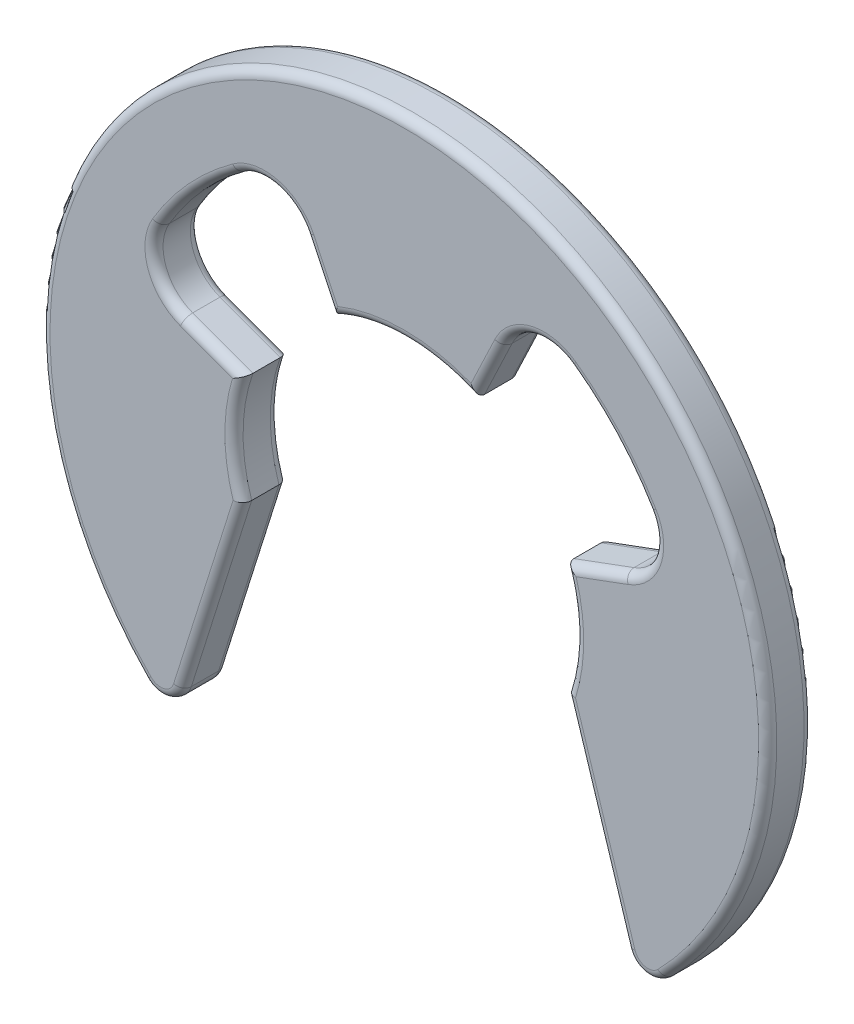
ISO-10303-21;
HEADER;
FILE_DESCRIPTION(('STEP AP214'),'2;1');
FILE_NAME('part.step','',(''),(''),'','','');
FILE_SCHEMA(('AUTOMOTIVE_DESIGN { 1 0 10303 214 1 1 1 1 }'));
ENDSEC;
DATA;
#1=APPLICATION_CONTEXT('core data for automotive mechanical design processes');
#2=APPLICATION_PROTOCOL_DEFINITION('international standard','automotive_design',2000,#1);
#3=PRODUCT_CONTEXT('',#1,'mechanical');
#4=PRODUCT('Part','Part','',(#3));
#5=PRODUCT_RELATED_PRODUCT_CATEGORY('part','',(#4));
#6=PRODUCT_DEFINITION_FORMATION('','',#4);
#7=PRODUCT_DEFINITION_CONTEXT('part definition',#1,'design');
#8=PRODUCT_DEFINITION('design','',#6,#7);
#9=PRODUCT_DEFINITION_SHAPE('','',#8);
#10=(LENGTH_UNIT() NAMED_UNIT(*) SI_UNIT(.MILLI.,.METRE.));
#11=(NAMED_UNIT(*) PLANE_ANGLE_UNIT() SI_UNIT($,.RADIAN.));
#12=(NAMED_UNIT(*) SI_UNIT($,.STERADIAN.) SOLID_ANGLE_UNIT());
#13=UNCERTAINTY_MEASURE_WITH_UNIT(LENGTH_MEASURE(1.E-05),#10,'distance_accuracy_value','');
#14=(GEOMETRIC_REPRESENTATION_CONTEXT(3) GLOBAL_UNCERTAINTY_ASSIGNED_CONTEXT((#13)) GLOBAL_UNIT_ASSIGNED_CONTEXT((#10,
#11,#12)) REPRESENTATION_CONTEXT('',''));
#15=CARTESIAN_POINT('',(0.,0.,0.));
#16=DIRECTION('',(0.,0.,1.));
#17=DIRECTION('',(1.,0.,0.));
#18=AXIS2_PLACEMENT_3D('',#15,#16,#17);
#19=CARTESIAN_POINT('',(0.,0.,1.));
#20=DIRECTION('',(0.,0.,-1.));
#21=DIRECTION('',(-1.,0.,0.));
#22=AXIS2_PLACEMENT_3D('',#19,#20,#21);
#23=CYLINDRICAL_SURFACE('',#22,3.75);
#24=DIRECTION('',(0.,0.,-1.));
#25=VECTOR('',#24,1.);
#26=CARTESIAN_POINT('',(3.53239367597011,1.25884666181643,1.));
#27=LINE('',#26,#25);
#28=CARTESIAN_POINT('',(3.53239367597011,1.25884666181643,0.8));
#29=VERTEX_POINT('',#28);
#30=CARTESIAN_POINT('',(3.53239367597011,1.25884666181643,0.2));
#31=VERTEX_POINT('',#30);
#32=EDGE_CURVE('E761',#29,#31,#27,.T.);
#33=ORIENTED_EDGE('',*,*,#32,.T.);
#34=CARTESIAN_POINT('',(0.,0.,0.2));
#35=DIRECTION('',(0.,0.,1.));
#36=DIRECTION('',(1.,0.,0.));
#37=AXIS2_PLACEMENT_3D('',#34,#35,#36);
#38=CIRCLE('',#37,3.75);
#39=CARTESIAN_POINT('',(3.55958154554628,-1.17977931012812,0.2));
#40=VERTEX_POINT('',#39);
#41=EDGE_CURVE('E405',#31,#40,#38,.F.);
#42=ORIENTED_EDGE('',*,*,#41,.T.);
#43=DIRECTION('',(0.,0.,-1.));
#44=VECTOR('',#43,1.);
#45=CARTESIAN_POINT('',(3.55958154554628,-1.17977931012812,1.));
#46=LINE('',#45,#44);
#47=CARTESIAN_POINT('',(3.55958154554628,-1.17977931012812,0.8));
#48=VERTEX_POINT('',#47);
#49=EDGE_CURVE('E284',#48,#40,#46,.T.);
#50=ORIENTED_EDGE('',*,*,#49,.F.);
#51=CARTESIAN_POINT('',(0.,0.,0.8));
#52=DIRECTION('',(0.,0.,1.));
#53=DIRECTION('',(1.,0.,0.));
#54=AXIS2_PLACEMENT_3D('',#51,#52,#53);
#55=CIRCLE('',#54,3.75);
#56=EDGE_CURVE('E403',#48,#29,#55,.T.);
#57=ORIENTED_EDGE('',*,*,#56,.T.);
#58=EDGE_LOOP('',(#33,#42,#50,#57));
#59=FACE_BOUND('',#58,.T.);
#60=ADVANCED_FACE('F31',(#59),#23,.F.);
#61=CARTESIAN_POINT('',(3.55958154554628,-1.17977931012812,1.));
#62=DIRECTION('',(0.953726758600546,0.300674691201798,0.));
#63=DIRECTION('',(-0.300674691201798,0.953726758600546,0.));
#64=AXIS2_PLACEMENT_3D('',#61,#62,#63);
#65=PLANE('',#64);
#66=ORIENTED_EDGE('',*,*,#49,.T.);
#67=DIRECTION('',(0.300674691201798,-0.953726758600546,0.));
#68=VECTOR('',#67,1.);
#69=CARTESIAN_POINT('',(3.55958154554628,-1.17977931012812,0.2));
#70=LINE('',#69,#68);
#71=CARTESIAN_POINT('',(4.8874968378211,-5.39186760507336,0.2));
#72=VERTEX_POINT('',#71);
#73=EDGE_CURVE('E283',#40,#72,#70,.T.);
#74=ORIENTED_EDGE('',*,*,#73,.T.);
#75=DIRECTION('',(0.,0.,-1.));
#76=VECTOR('',#75,1.);
#77=CARTESIAN_POINT('',(4.8874968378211,-5.39186760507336,1.));
#78=LINE('',#77,#76);
#79=CARTESIAN_POINT('',(4.8874968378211,-5.39186760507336,0.8));
#80=VERTEX_POINT('',#79);
#81=EDGE_CURVE('E265',#80,#72,#78,.T.);
#82=ORIENTED_EDGE('',*,*,#81,.F.);
#83=DIRECTION('',(0.300674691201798,-0.953726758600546,0.));
#84=VECTOR('',#83,1.);
#85=CARTESIAN_POINT('',(3.55958154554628,-1.17977931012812,0.8));
#86=LINE('',#85,#84);
#87=EDGE_CURVE('E280',#80,#48,#86,.F.);
#88=ORIENTED_EDGE('',*,*,#87,.T.);
#89=EDGE_LOOP('',(#66,#74,#82,#88));
#90=FACE_BOUND('',#89,.T.);
#91=ADVANCED_FACE('F278',(#90),#65,.F.);
#92=CARTESIAN_POINT('',(5.36436021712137,-5.24153025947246,1.));
#93=DIRECTION('',(0.,0.,-1.));
#94=DIRECTION('',(-1.,0.,0.));
#95=AXIS2_PLACEMENT_3D('',#92,#93,#94);
#96=CYLINDRICAL_SURFACE('',#95,0.5);
#97=ORIENTED_EDGE('',*,*,#81,.T.);
#98=CARTESIAN_POINT('',(5.36436021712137,-5.24153025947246,0.2));
#99=DIRECTION('',(0.,0.,1.));
#100=DIRECTION('',(1.,0.,0.));
#101=AXIS2_PLACEMENT_3D('',#98,#99,#100);
#102=CIRCLE('',#101,0.5);
#103=CARTESIAN_POINT('',(5.72198423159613,-5.59096561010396,0.2));
#104=VERTEX_POINT('',#103);
#105=EDGE_CURVE('E272',#72,#104,#102,.T.);
#106=ORIENTED_EDGE('',*,*,#105,.T.);
#107=DIRECTION('',(0.,0.,-1.));
#108=VECTOR('',#107,1.);
#109=CARTESIAN_POINT('',(5.72198423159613,-5.59096561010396,1.));
#110=LINE('',#109,#108);
#111=CARTESIAN_POINT('',(5.72198423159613,-5.59096561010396,0.8));
#112=VERTEX_POINT('',#111);
#113=EDGE_CURVE('E267',#112,#104,#110,.T.);
#114=ORIENTED_EDGE('',*,*,#113,.F.);
#115=CARTESIAN_POINT('',(5.36436021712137,-5.24153025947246,0.8));
#116=DIRECTION('',(0.,0.,1.));
#117=DIRECTION('',(1.,0.,0.));
#118=AXIS2_PLACEMENT_3D('',#115,#116,#117);
#119=CIRCLE('',#118,0.5);
#120=EDGE_CURVE('E262',#112,#80,#119,.F.);
#121=ORIENTED_EDGE('',*,*,#120,.T.);
#122=EDGE_LOOP('',(#97,#106,#114,#121));
#123=FACE_BOUND('',#122,.T.);
#124=ADVANCED_FACE('F264',(#123),#96,.T.);
#125=CARTESIAN_POINT('',(0.,0.,1.));
#126=DIRECTION('',(0.,0.,-1.));
#127=DIRECTION('',(-1.,0.,0.));
#128=AXIS2_PLACEMENT_3D('',#125,#126,#127);
#129=CYLINDRICAL_SURFACE('',#128,8.);
#130=ORIENTED_EDGE('',*,*,#113,.T.);
#131=CARTESIAN_POINT('',(0.,0.,0.2));
#132=DIRECTION('',(0.,0.,1.));
#133=DIRECTION('',(1.,0.,0.));
#134=AXIS2_PLACEMENT_3D('',#131,#132,#133);
#135=CIRCLE('',#134,8.);
#136=CARTESIAN_POINT('',(-5.72198423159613,-5.59096561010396,0.2));
#137=VERTEX_POINT('',#136);
#138=EDGE_CURVE('E344',#104,#137,#135,.T.);
#139=ORIENTED_EDGE('',*,*,#138,.T.);
#140=DIRECTION('',(0.,0.,-1.));
#141=VECTOR('',#140,1.);
#142=CARTESIAN_POINT('',(-5.72198423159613,-5.59096561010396,1.));
#143=LINE('',#142,#141);
#144=CARTESIAN_POINT('',(-5.72198423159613,-5.59096561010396,0.8));
#145=VERTEX_POINT('',#144);
#146=EDGE_CURVE('E784',#145,#137,#143,.T.);
#147=ORIENTED_EDGE('',*,*,#146,.F.);
#148=CARTESIAN_POINT('',(0.,0.,0.8));
#149=DIRECTION('',(0.,0.,1.));
#150=DIRECTION('',(1.,0.,0.));
#151=AXIS2_PLACEMENT_3D('',#148,#149,#150);
#152=CIRCLE('',#151,8.);
#153=EDGE_CURVE('E342',#145,#112,#152,.F.);
#154=ORIENTED_EDGE('',*,*,#153,.T.);
#155=EDGE_LOOP('',(#130,#139,#147,#154));
#156=FACE_BOUND('',#155,.T.);
#157=ADVANCED_FACE('F746',(#156),#129,.T.);
#158=CARTESIAN_POINT('',(-5.36436021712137,-5.24153025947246,1.));
#159=DIRECTION('',(0.,0.,-1.));
#160=DIRECTION('',(-1.,0.,0.));
#161=AXIS2_PLACEMENT_3D('',#158,#159,#160);
#162=CYLINDRICAL_SURFACE('',#161,0.5);
#163=ORIENTED_EDGE('',*,*,#146,.T.);
#164=CARTESIAN_POINT('',(-5.36436021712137,-5.24153025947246,0.2));
#165=DIRECTION('',(0.,0.,1.));
#166=DIRECTION('',(1.,0.,0.));
#167=AXIS2_PLACEMENT_3D('',#164,#165,#166);
#168=CIRCLE('',#167,0.5);
#169=CARTESIAN_POINT('',(-4.8874968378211,-5.39186760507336,0.2));
#170=VERTEX_POINT('',#169);
#171=EDGE_CURVE('E348',#137,#170,#168,.T.);
#172=ORIENTED_EDGE('',*,*,#171,.T.);
#173=DIRECTION('',(0.,0.,-1.));
#174=VECTOR('',#173,1.);
#175=CARTESIAN_POINT('',(-4.8874968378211,-5.39186760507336,1.));
#176=LINE('',#175,#174);
#177=CARTESIAN_POINT('',(-4.8874968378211,-5.39186760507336,0.8));
#178=VERTEX_POINT('',#177);
#179=EDGE_CURVE('E865',#178,#170,#176,.T.);
#180=ORIENTED_EDGE('',*,*,#179,.F.);
#181=CARTESIAN_POINT('',(-5.36436021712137,-5.24153025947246,0.8));
#182=DIRECTION('',(0.,0.,1.));
#183=DIRECTION('',(1.,0.,0.));
#184=AXIS2_PLACEMENT_3D('',#181,#182,#183);
#185=CIRCLE('',#184,0.5);
#186=EDGE_CURVE('E346',#178,#145,#185,.F.);
#187=ORIENTED_EDGE('',*,*,#186,.T.);
#188=EDGE_LOOP('',(#163,#172,#180,#187));
#189=FACE_BOUND('',#188,.T.);
#190=ADVANCED_FACE('F742',(#189),#162,.T.);
#191=CARTESIAN_POINT('',(-3.55958154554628,-1.17977931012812,1.));
#192=DIRECTION('',(-0.953726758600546,0.300674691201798,0.));
#193=DIRECTION('',(-0.300674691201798,-0.953726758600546,0.));
#194=AXIS2_PLACEMENT_3D('',#191,#192,#193);
#195=PLANE('',#194);
#196=ORIENTED_EDGE('',*,*,#179,.T.);
#197=DIRECTION('',(0.300674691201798,0.953726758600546,0.));
#198=VECTOR('',#197,1.);
#199=CARTESIAN_POINT('',(-3.55958154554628,-1.17977931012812,0.2));
#200=LINE('',#199,#198);
#201=CARTESIAN_POINT('',(-3.55958154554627,-1.17977931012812,0.2));
#202=VERTEX_POINT('',#201);
#203=EDGE_CURVE('E352',#170,#202,#200,.T.);
#204=ORIENTED_EDGE('',*,*,#203,.T.);
#205=DIRECTION('',(0.,0.,-1.));
#206=VECTOR('',#205,1.);
#207=CARTESIAN_POINT('',(-3.55958154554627,-1.17977931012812,1.));
#208=LINE('',#207,#206);
#209=CARTESIAN_POINT('',(-3.55958154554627,-1.17977931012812,0.8));
#210=VERTEX_POINT('',#209);
#211=EDGE_CURVE('E862',#210,#202,#208,.T.);
#212=ORIENTED_EDGE('',*,*,#211,.F.);
#213=DIRECTION('',(0.300674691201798,0.953726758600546,0.));
#214=VECTOR('',#213,1.);
#215=CARTESIAN_POINT('',(-4.8874968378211,-5.39186760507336,0.8));
#216=LINE('',#215,#214);
#217=EDGE_CURVE('E350',#210,#178,#216,.F.);
#218=ORIENTED_EDGE('',*,*,#217,.T.);
#219=EDGE_LOOP('',(#196,#204,#212,#218));
#220=FACE_BOUND('',#219,.T.);
#221=ADVANCED_FACE('F738',(#220),#195,.F.);
#222=CARTESIAN_POINT('',(0.,0.,1.));
#223=DIRECTION('',(0.,0.,-1.));
#224=DIRECTION('',(-1.,0.,0.));
#225=AXIS2_PLACEMENT_3D('',#222,#223,#224);
#226=CYLINDRICAL_SURFACE('',#225,3.75);
#227=ORIENTED_EDGE('',*,*,#211,.T.);
#228=CARTESIAN_POINT('',(0.,0.,0.2));
#229=DIRECTION('',(0.,0.,1.));
#230=DIRECTION('',(1.,0.,0.));
#231=AXIS2_PLACEMENT_3D('',#228,#229,#230);
#232=CIRCLE('',#231,3.75);
#233=CARTESIAN_POINT('',(-3.53239367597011,1.25884666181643,0.2));
#234=VERTEX_POINT('',#233);
#235=EDGE_CURVE('E356',#202,#234,#232,.F.);
#236=ORIENTED_EDGE('',*,*,#235,.T.);
#237=DIRECTION('',(0.,0.,-1.));
#238=VECTOR('',#237,1.);
#239=CARTESIAN_POINT('',(-3.53239367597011,1.25884666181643,1.));
#240=LINE('',#239,#238);
#241=CARTESIAN_POINT('',(-3.53239367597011,1.25884666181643,0.8));
#242=VERTEX_POINT('',#241);
#243=EDGE_CURVE('E859',#242,#234,#240,.T.);
#244=ORIENTED_EDGE('',*,*,#243,.F.);
#245=CARTESIAN_POINT('',(0.,0.,0.8));
#246=DIRECTION('',(0.,0.,1.));
#247=DIRECTION('',(1.,0.,0.));
#248=AXIS2_PLACEMENT_3D('',#245,#246,#247);
#249=CIRCLE('',#248,3.75);
#250=EDGE_CURVE('E354',#242,#210,#249,.T.);
#251=ORIENTED_EDGE('',*,*,#250,.T.);
#252=EDGE_LOOP('',(#227,#236,#244,#251));
#253=FACE_BOUND('',#252,.T.);
#254=ADVANCED_FACE('F734',(#253),#226,.F.);
#255=CARTESIAN_POINT('',(-3.53239367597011,1.25884666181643,1.));
#256=DIRECTION('',(-0.34708561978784,-0.937833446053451,0.));
#257=DIRECTION('',(0.937833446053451,-0.34708561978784,0.));
#258=AXIS2_PLACEMENT_3D('',#255,#256,#257);
#259=PLANE('',#258);
#260=ORIENTED_EDGE('',*,*,#243,.T.);
#261=DIRECTION('',(-0.937833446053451,0.34708561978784,0.));
#262=VECTOR('',#261,1.);
#263=CARTESIAN_POINT('',(-3.53239367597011,1.25884666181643,0.2));
#264=LINE('',#263,#262);
#265=CARTESIAN_POINT('',(-4.85733603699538,1.749198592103,0.2));
#266=VERTEX_POINT('',#265);
#267=EDGE_CURVE('E360',#234,#266,#264,.T.);
#268=ORIENTED_EDGE('',*,*,#267,.T.);
#269=DIRECTION('',(0.,0.,-1.));
#270=VECTOR('',#269,1.);
#271=CARTESIAN_POINT('',(-4.85733603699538,1.749198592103,1.));
#272=LINE('',#271,#270);
#273=CARTESIAN_POINT('',(-4.85733603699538,1.749198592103,0.8));
#274=VERTEX_POINT('',#273);
#275=EDGE_CURVE('E856',#274,#266,#272,.T.);
#276=ORIENTED_EDGE('',*,*,#275,.F.);
#277=DIRECTION('',(-0.937833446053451,0.34708561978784,0.));
#278=VECTOR('',#277,1.);
#279=CARTESIAN_POINT('',(-3.53239367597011,1.25884666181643,0.8));
#280=LINE('',#279,#278);
#281=EDGE_CURVE('E358',#274,#242,#280,.F.);
#282=ORIENTED_EDGE('',*,*,#281,.T.);
#283=EDGE_LOOP('',(#260,#268,#276,#282));
#284=FACE_BOUND('',#283,.T.);
#285=ADVANCED_FACE('F730',(#284),#259,.F.);
#286=CARTESIAN_POINT('',(-4.51025041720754,2.68703203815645,1.));
#287=DIRECTION('',(0.,0.,-1.));
#288=DIRECTION('',(-1.,0.,0.));
#289=AXIS2_PLACEMENT_3D('',#286,#287,#288);
#290=CYLINDRICAL_SURFACE('',#289,1.);
#291=ORIENTED_EDGE('',*,*,#275,.T.);
#292=CARTESIAN_POINT('',(-4.51025041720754,2.68703203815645,0.2));
#293=DIRECTION('',(0.,0.,1.));
#294=DIRECTION('',(1.,0.,0.));
#295=AXIS2_PLACEMENT_3D('',#292,#293,#294);
#296=CIRCLE('',#295,1.);
#297=CARTESIAN_POINT('',(-5.36934573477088,3.19884766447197,0.2));
#298=VERTEX_POINT('',#297);
#299=EDGE_CURVE('E364',#266,#298,#296,.F.);
#300=ORIENTED_EDGE('',*,*,#299,.T.);
#301=DIRECTION('',(0.,0.,-1.));
#302=VECTOR('',#301,1.);
#303=CARTESIAN_POINT('',(-5.36934573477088,3.19884766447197,1.));
#304=LINE('',#303,#302);
#305=CARTESIAN_POINT('',(-5.36934573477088,3.19884766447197,0.8));
#306=VERTEX_POINT('',#305);
#307=EDGE_CURVE('E853',#306,#298,#304,.T.);
#308=ORIENTED_EDGE('',*,*,#307,.F.);
#309=CARTESIAN_POINT('',(-4.51025041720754,2.68703203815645,0.8));
#310=DIRECTION('',(0.,0.,1.));
#311=DIRECTION('',(1.,0.,0.));
#312=AXIS2_PLACEMENT_3D('',#309,#310,#311);
#313=CIRCLE('',#312,1.);
#314=EDGE_CURVE('E362',#306,#274,#313,.T.);
#315=ORIENTED_EDGE('',*,*,#314,.T.);
#316=EDGE_LOOP('',(#291,#300,#308,#315));
#317=FACE_BOUND('',#316,.T.);
#318=ADVANCED_FACE('F726',(#317),#290,.F.);
#319=CARTESIAN_POINT('',(0.,0.,1.));
#320=DIRECTION('',(0.,0.,-1.));
#321=DIRECTION('',(-1.,0.,0.));
#322=AXIS2_PLACEMENT_3D('',#319,#320,#321);
#323=CYLINDRICAL_SURFACE('',#322,6.25);
#324=ORIENTED_EDGE('',*,*,#307,.T.);
#325=CARTESIAN_POINT('',(0.,0.,0.2));
#326=DIRECTION('',(0.,0.,1.));
#327=DIRECTION('',(1.,0.,0.));
#328=AXIS2_PLACEMENT_3D('',#325,#326,#327);
#329=CIRCLE('',#328,6.25);
#330=CARTESIAN_POINT('',(-3.66269488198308,5.06430313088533,0.2));
#331=VERTEX_POINT('',#330);
#332=EDGE_CURVE('E368',#298,#331,#329,.F.);
#333=ORIENTED_EDGE('',*,*,#332,.T.);
#334=DIRECTION('',(0.,0.,-1.));
#335=VECTOR('',#334,1.);
#336=CARTESIAN_POINT('',(-3.66269488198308,5.06430313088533,1.));
#337=LINE('',#336,#335);
#338=CARTESIAN_POINT('',(-3.66269488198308,5.06430313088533,0.8));
#339=VERTEX_POINT('',#338);
#340=EDGE_CURVE('E850',#339,#331,#337,.T.);
#341=ORIENTED_EDGE('',*,*,#340,.F.);
#342=CARTESIAN_POINT('',(0.,0.,0.8));
#343=DIRECTION('',(0.,0.,1.));
#344=DIRECTION('',(1.,0.,0.));
#345=AXIS2_PLACEMENT_3D('',#342,#343,#344);
#346=CIRCLE('',#345,6.25);
#347=EDGE_CURVE('E366',#339,#306,#346,.T.);
#348=ORIENTED_EDGE('',*,*,#347,.T.);
#349=EDGE_LOOP('',(#324,#333,#341,#348));
#350=FACE_BOUND('',#349,.T.);
#351=ADVANCED_FACE('F722',(#350),#323,.F.);
#352=CARTESIAN_POINT('',(-3.07666370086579,4.25401462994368,1.));
#353=DIRECTION('',(0.,0.,-1.));
#354=DIRECTION('',(-1.,0.,0.));
#355=AXIS2_PLACEMENT_3D('',#352,#353,#354);
#356=CYLINDRICAL_SURFACE('',#355,1.);
#357=ORIENTED_EDGE('',*,*,#340,.T.);
#358=CARTESIAN_POINT('',(-3.07666370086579,4.25401462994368,0.2));
#359=DIRECTION('',(0.,0.,1.));
#360=DIRECTION('',(1.,0.,0.));
#361=AXIS2_PLACEMENT_3D('',#358,#359,#360);
#362=CIRCLE('',#361,1.);
#363=CARTESIAN_POINT('',(-2.17332983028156,4.68295275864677,0.2));
#364=VERTEX_POINT('',#363);
#365=EDGE_CURVE('E372',#331,#364,#362,.F.);
#366=ORIENTED_EDGE('',*,*,#365,.T.);
#367=DIRECTION('',(0.,0.,-1.));
#368=VECTOR('',#367,1.);
#369=CARTESIAN_POINT('',(-2.17332983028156,4.68295275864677,1.));
#370=LINE('',#369,#368);
#371=CARTESIAN_POINT('',(-2.17332983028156,4.68295275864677,0.8));
#372=VERTEX_POINT('',#371);
#373=EDGE_CURVE('E847',#372,#364,#370,.T.);
#374=ORIENTED_EDGE('',*,*,#373,.F.);
#375=CARTESIAN_POINT('',(-3.07666370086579,4.25401462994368,0.8));
#376=DIRECTION('',(0.,0.,1.));
#377=DIRECTION('',(1.,0.,0.));
#378=AXIS2_PLACEMENT_3D('',#375,#376,#377);
#379=CIRCLE('',#378,1.);
#380=EDGE_CURVE('E370',#372,#339,#379,.T.);
#381=ORIENTED_EDGE('',*,*,#380,.T.);
#382=EDGE_LOOP('',(#357,#366,#374,#381));
#383=FACE_BOUND('',#382,.T.);
#384=ADVANCED_FACE('F718',(#383),#356,.F.);
#385=CARTESIAN_POINT('',(-1.56733918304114,3.40675034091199,1.));
#386=DIRECTION('',(0.903333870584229,0.428938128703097,0.));
#387=DIRECTION('',(-0.428938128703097,0.90333387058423,0.));
#388=AXIS2_PLACEMENT_3D('',#385,#386,#387);
#389=PLANE('',#388);
#390=ORIENTED_EDGE('',*,*,#373,.T.);
#391=DIRECTION('',(0.428938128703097,-0.90333387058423,0.));
#392=VECTOR('',#391,1.);
#393=CARTESIAN_POINT('',(-1.56733918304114,3.40675034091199,0.2));
#394=LINE('',#393,#392);
#395=CARTESIAN_POINT('',(-1.56733918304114,3.40675034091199,0.2));
#396=VERTEX_POINT('',#395);
#397=EDGE_CURVE('E376',#364,#396,#394,.T.);
#398=ORIENTED_EDGE('',*,*,#397,.T.);
#399=DIRECTION('',(0.,0.,-1.));
#400=VECTOR('',#399,1.);
#401=CARTESIAN_POINT('',(-1.56733918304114,3.40675034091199,1.));
#402=LINE('',#401,#400);
#403=CARTESIAN_POINT('',(-1.56733918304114,3.40675034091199,0.8));
#404=VERTEX_POINT('',#403);
#405=EDGE_CURVE('E844',#404,#396,#402,.T.);
#406=ORIENTED_EDGE('',*,*,#405,.F.);
#407=DIRECTION('',(0.428938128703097,-0.90333387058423,0.));
#408=VECTOR('',#407,1.);
#409=CARTESIAN_POINT('',(-2.17332983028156,4.68295275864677,0.8));
#410=LINE('',#409,#408);
#411=EDGE_CURVE('E374',#404,#372,#410,.F.);
#412=ORIENTED_EDGE('',*,*,#411,.T.);
#413=EDGE_LOOP('',(#390,#398,#406,#412));
#414=FACE_BOUND('',#413,.T.);
#415=ADVANCED_FACE('F714',(#414),#389,.F.);
#416=CARTESIAN_POINT('',(0.,0.,1.));
#417=DIRECTION('',(0.,0.,-1.));
#418=DIRECTION('',(-1.,0.,0.));
#419=AXIS2_PLACEMENT_3D('',#416,#417,#418);
#420=CYLINDRICAL_SURFACE('',#419,3.75);
#421=ORIENTED_EDGE('',*,*,#405,.T.);
#422=CARTESIAN_POINT('',(0.,0.,0.2));
#423=DIRECTION('',(0.,0.,1.));
#424=DIRECTION('',(1.,0.,0.));
#425=AXIS2_PLACEMENT_3D('',#422,#423,#424);
#426=CIRCLE('',#425,3.75);
#427=CARTESIAN_POINT('',(1.56733918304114,3.40675034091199,0.2));
#428=VERTEX_POINT('',#427);
#429=EDGE_CURVE('E380',#396,#428,#426,.F.);
#430=ORIENTED_EDGE('',*,*,#429,.T.);
#431=DIRECTION('',(0.,0.,-1.));
#432=VECTOR('',#431,1.);
#433=CARTESIAN_POINT('',(1.56733918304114,3.40675034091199,1.));
#434=LINE('',#433,#432);
#435=CARTESIAN_POINT('',(1.56733918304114,3.40675034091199,0.8));
#436=VERTEX_POINT('',#435);
#437=EDGE_CURVE('E841',#436,#428,#434,.T.);
#438=ORIENTED_EDGE('',*,*,#437,.F.);
#439=CARTESIAN_POINT('',(0.,0.,0.8));
#440=DIRECTION('',(0.,0.,1.));
#441=DIRECTION('',(1.,0.,0.));
#442=AXIS2_PLACEMENT_3D('',#439,#440,#441);
#443=CIRCLE('',#442,3.75);
#444=EDGE_CURVE('E378',#436,#404,#443,.T.);
#445=ORIENTED_EDGE('',*,*,#444,.T.);
#446=EDGE_LOOP('',(#421,#430,#438,#445));
#447=FACE_BOUND('',#446,.T.);
#448=ADVANCED_FACE('F710',(#447),#420,.F.);
#449=CARTESIAN_POINT('',(1.56733918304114,3.40675034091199,1.));
#450=DIRECTION('',(-0.903333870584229,0.428938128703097,0.));
#451=DIRECTION('',(-0.428938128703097,-0.90333387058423,0.));
#452=AXIS2_PLACEMENT_3D('',#449,#450,#451);
#453=PLANE('',#452);
#454=ORIENTED_EDGE('',*,*,#437,.T.);
#455=DIRECTION('',(0.428938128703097,0.90333387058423,0.));
#456=VECTOR('',#455,1.);
#457=CARTESIAN_POINT('',(1.56733918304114,3.40675034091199,0.2));
#458=LINE('',#457,#456);
#459=CARTESIAN_POINT('',(2.17332983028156,4.68295275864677,0.2));
#460=VERTEX_POINT('',#459);
#461=EDGE_CURVE('E384',#428,#460,#458,.T.);
#462=ORIENTED_EDGE('',*,*,#461,.T.);
#463=DIRECTION('',(0.,0.,-1.));
#464=VECTOR('',#463,1.);
#465=CARTESIAN_POINT('',(2.17332983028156,4.68295275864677,1.));
#466=LINE('',#465,#464);
#467=CARTESIAN_POINT('',(2.17332983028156,4.68295275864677,0.8));
#468=VERTEX_POINT('',#467);
#469=EDGE_CURVE('E838',#468,#460,#466,.T.);
#470=ORIENTED_EDGE('',*,*,#469,.F.);
#471=DIRECTION('',(0.428938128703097,0.90333387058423,0.));
#472=VECTOR('',#471,1.);
#473=CARTESIAN_POINT('',(1.56733918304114,3.40675034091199,0.8));
#474=LINE('',#473,#472);
#475=EDGE_CURVE('E382',#468,#436,#474,.F.);
#476=ORIENTED_EDGE('',*,*,#475,.T.);
#477=EDGE_LOOP('',(#454,#462,#470,#476));
#478=FACE_BOUND('',#477,.T.);
#479=ADVANCED_FACE('F706',(#478),#453,.F.);
#480=CARTESIAN_POINT('',(3.07666370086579,4.25401462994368,1.));
#481=DIRECTION('',(0.,0.,-1.));
#482=DIRECTION('',(-1.,0.,0.));
#483=AXIS2_PLACEMENT_3D('',#480,#481,#482);
#484=CYLINDRICAL_SURFACE('',#483,1.);
#485=ORIENTED_EDGE('',*,*,#469,.T.);
#486=CARTESIAN_POINT('',(3.07666370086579,4.25401462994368,0.2));
#487=DIRECTION('',(0.,0.,1.));
#488=DIRECTION('',(1.,0.,0.));
#489=AXIS2_PLACEMENT_3D('',#486,#487,#488);
#490=CIRCLE('',#489,1.);
#491=CARTESIAN_POINT('',(3.66269488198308,5.06430313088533,0.2));
#492=VERTEX_POINT('',#491);
#493=EDGE_CURVE('E388',#460,#492,#490,.F.);
#494=ORIENTED_EDGE('',*,*,#493,.T.);
#495=DIRECTION('',(0.,0.,-1.));
#496=VECTOR('',#495,1.);
#497=CARTESIAN_POINT('',(3.66269488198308,5.06430313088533,1.));
#498=LINE('',#497,#496);
#499=CARTESIAN_POINT('',(3.66269488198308,5.06430313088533,0.8));
#500=VERTEX_POINT('',#499);
#501=EDGE_CURVE('E835',#500,#492,#498,.T.);
#502=ORIENTED_EDGE('',*,*,#501,.F.);
#503=CARTESIAN_POINT('',(3.07666370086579,4.25401462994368,0.8));
#504=DIRECTION('',(0.,0.,1.));
#505=DIRECTION('',(1.,0.,0.));
#506=AXIS2_PLACEMENT_3D('',#503,#504,#505);
#507=CIRCLE('',#506,1.);
#508=EDGE_CURVE('E386',#500,#468,#507,.T.);
#509=ORIENTED_EDGE('',*,*,#508,.T.);
#510=EDGE_LOOP('',(#485,#494,#502,#509));
#511=FACE_BOUND('',#510,.T.);
#512=ADVANCED_FACE('F702',(#511),#484,.F.);
#513=CARTESIAN_POINT('',(0.,0.,1.));
#514=DIRECTION('',(0.,0.,-1.));
#515=DIRECTION('',(-1.,0.,0.));
#516=AXIS2_PLACEMENT_3D('',#513,#514,#515);
#517=CYLINDRICAL_SURFACE('',#516,6.25);
#518=ORIENTED_EDGE('',*,*,#501,.T.);
#519=CARTESIAN_POINT('',(0.,0.,0.2));
#520=DIRECTION('',(0.,0.,1.));
#521=DIRECTION('',(1.,0.,0.));
#522=AXIS2_PLACEMENT_3D('',#519,#520,#521);
#523=CIRCLE('',#522,6.25);
#524=CARTESIAN_POINT('',(5.36934573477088,3.19884766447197,0.2));
#525=VERTEX_POINT('',#524);
#526=EDGE_CURVE('E392',#492,#525,#523,.F.);
#527=ORIENTED_EDGE('',*,*,#526,.T.);
#528=DIRECTION('',(0.,0.,-1.));
#529=VECTOR('',#528,1.);
#530=CARTESIAN_POINT('',(5.36934573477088,3.19884766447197,1.));
#531=LINE('',#530,#529);
#532=CARTESIAN_POINT('',(5.36934573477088,3.19884766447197,0.8));
#533=VERTEX_POINT('',#532);
#534=EDGE_CURVE('E832',#533,#525,#531,.T.);
#535=ORIENTED_EDGE('',*,*,#534,.F.);
#536=CARTESIAN_POINT('',(0.,0.,0.8));
#537=DIRECTION('',(0.,0.,1.));
#538=DIRECTION('',(1.,0.,0.));
#539=AXIS2_PLACEMENT_3D('',#536,#537,#538);
#540=CIRCLE('',#539,6.25);
#541=EDGE_CURVE('E390',#533,#500,#540,.T.);
#542=ORIENTED_EDGE('',*,*,#541,.T.);
#543=EDGE_LOOP('',(#518,#527,#535,#542));
#544=FACE_BOUND('',#543,.T.);
#545=ADVANCED_FACE('F698',(#544),#517,.F.);
#546=CARTESIAN_POINT('',(4.51025041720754,2.68703203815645,1.));
#547=DIRECTION('',(0.,0.,-1.));
#548=DIRECTION('',(-1.,0.,0.));
#549=AXIS2_PLACEMENT_3D('',#546,#547,#548);
#550=CYLINDRICAL_SURFACE('',#549,1.);
#551=ORIENTED_EDGE('',*,*,#534,.T.);
#552=CARTESIAN_POINT('',(4.51025041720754,2.68703203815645,0.2));
#553=DIRECTION('',(0.,0.,1.));
#554=DIRECTION('',(1.,0.,0.));
#555=AXIS2_PLACEMENT_3D('',#552,#553,#554);
#556=CIRCLE('',#555,1.);
#557=CARTESIAN_POINT('',(4.85733603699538,1.749198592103,0.2));
#558=VERTEX_POINT('',#557);
#559=EDGE_CURVE('E396',#525,#558,#556,.F.);
#560=ORIENTED_EDGE('',*,*,#559,.T.);
#561=DIRECTION('',(0.,0.,-1.));
#562=VECTOR('',#561,1.);
#563=CARTESIAN_POINT('',(4.85733603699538,1.749198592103,1.));
#564=LINE('',#563,#562);
#565=CARTESIAN_POINT('',(4.85733603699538,1.749198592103,0.8));
#566=VERTEX_POINT('',#565);
#567=EDGE_CURVE('E764',#566,#558,#564,.T.);
#568=ORIENTED_EDGE('',*,*,#567,.F.);
#569=CARTESIAN_POINT('',(4.51025041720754,2.68703203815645,0.8));
#570=DIRECTION('',(0.,0.,1.));
#571=DIRECTION('',(1.,0.,0.));
#572=AXIS2_PLACEMENT_3D('',#569,#570,#571);
#573=CIRCLE('',#572,1.);
#574=EDGE_CURVE('E394',#566,#533,#573,.T.);
#575=ORIENTED_EDGE('',*,*,#574,.T.);
#576=EDGE_LOOP('',(#551,#560,#568,#575));
#577=FACE_BOUND('',#576,.T.);
#578=ADVANCED_FACE('F694',(#577),#550,.F.);
#579=CARTESIAN_POINT('',(3.53239367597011,1.25884666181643,1.));
#580=DIRECTION('',(0.34708561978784,-0.937833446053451,0.));
#581=DIRECTION('',(0.937833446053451,0.34708561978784,0.));
#582=AXIS2_PLACEMENT_3D('',#579,#580,#581);
#583=PLANE('',#582);
#584=ORIENTED_EDGE('',*,*,#567,.T.);
#585=DIRECTION('',(-0.937833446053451,-0.34708561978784,0.));
#586=VECTOR('',#585,1.);
#587=CARTESIAN_POINT('',(3.53239367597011,1.25884666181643,0.2));
#588=LINE('',#587,#586);
#589=EDGE_CURVE('E401',#558,#31,#588,.T.);
#590=ORIENTED_EDGE('',*,*,#589,.T.);
#591=ORIENTED_EDGE('',*,*,#32,.F.);
#592=DIRECTION('',(-0.937833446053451,-0.34708561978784,0.));
#593=VECTOR('',#592,1.);
#594=CARTESIAN_POINT('',(4.85733603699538,1.749198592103,0.8));
#595=LINE('',#594,#593);
#596=EDGE_CURVE('E398',#29,#566,#595,.F.);
#597=ORIENTED_EDGE('',*,*,#596,.T.);
#598=EDGE_LOOP('',(#584,#590,#591,#597));
#599=FACE_BOUND('',#598,.T.);
#600=ADVANCED_FACE('F691',(#599),#583,.F.);
#601=CARTESIAN_POINT('',(0.,0.,1.));
#602=DIRECTION('',(0.,0.,1.));
#603=DIRECTION('',(1.,0.,0.));
#604=AXIS2_PLACEMENT_3D('',#601,#602,#603);
#605=PLANE('',#604);
#606=CARTESIAN_POINT('',(4.51025041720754,2.68703203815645,1.));
#607=DIRECTION('',(0.,0.,1.));
#608=DIRECTION('',(1.,0.,0.));
#609=AXIS2_PLACEMENT_3D('',#606,#607,#608);
#610=CIRCLE('',#609,1.2);
#611=CARTESIAN_POINT('',(5.54116479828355,3.30121078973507,1.));
#612=VERTEX_POINT('',#611);
#613=CARTESIAN_POINT('',(4.92675316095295,1.56163190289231,1.));
#614=VERTEX_POINT('',#613);
#615=EDGE_CURVE('E38',#612,#614,#610,.F.);
#616=ORIENTED_EDGE('',*,*,#615,.T.);
#617=DIRECTION('',(-0.937833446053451,-0.34708561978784,0.));
#618=VECTOR('',#617,1.);
#619=CARTESIAN_POINT('',(3.60181079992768,1.07127997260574,1.));
#620=LINE('',#619,#618);
#621=CARTESIAN_POINT('',(3.78247671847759,1.13814316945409,1.));
#622=VERTEX_POINT('',#621);
#623=EDGE_CURVE('E11',#614,#622,#620,.T.);
#624=ORIENTED_EDGE('',*,*,#623,.T.);
#625=CARTESIAN_POINT('',(0.,0.,1.));
#626=DIRECTION('',(0.,0.,1.));
#627=DIRECTION('',(1.,0.,0.));
#628=AXIS2_PLACEMENT_3D('',#625,#626,#627);
#629=CIRCLE('',#628,3.95);
#630=CARTESIAN_POINT('',(3.76949218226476,-1.1804358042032,1.));
#631=VERTEX_POINT('',#630);
#632=EDGE_CURVE('E407',#622,#631,#629,.F.);
#633=ORIENTED_EDGE('',*,*,#632,.T.);
#634=DIRECTION('',(0.300674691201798,-0.953726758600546,0.));
#635=VECTOR('',#634,1.);
#636=CARTESIAN_POINT('',(5.07824218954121,-5.331732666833,1.));
#637=LINE('',#636,#635);
#638=CARTESIAN_POINT('',(5.07824218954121,-5.331732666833,1.));
#639=VERTEX_POINT('',#638);
#640=EDGE_CURVE('E409',#631,#639,#637,.T.);
#641=ORIENTED_EDGE('',*,*,#640,.T.);
#642=CARTESIAN_POINT('',(5.36436021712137,-5.24153025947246,1.));
#643=DIRECTION('',(0.,0.,1.));
#644=DIRECTION('',(1.,0.,0.));
#645=AXIS2_PLACEMENT_3D('',#642,#643,#644);
#646=CIRCLE('',#645,0.3);
#647=CARTESIAN_POINT('',(5.57893462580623,-5.45119146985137,1.));
#648=VERTEX_POINT('',#647);
#649=EDGE_CURVE('E290',#639,#648,#646,.T.);
#650=ORIENTED_EDGE('',*,*,#649,.T.);
#651=CARTESIAN_POINT('',(0.,0.,1.));
#652=DIRECTION('',(0.,0.,1.));
#653=DIRECTION('',(1.,0.,0.));
#654=AXIS2_PLACEMENT_3D('',#651,#652,#653);
#655=CIRCLE('',#654,7.8);
#656=CARTESIAN_POINT('',(-5.57893462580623,-5.45119146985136,1.));
#657=VERTEX_POINT('',#656);
#658=EDGE_CURVE('E412',#648,#657,#655,.T.);
#659=ORIENTED_EDGE('',*,*,#658,.T.);
#660=CARTESIAN_POINT('',(-5.36436021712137,-5.24153025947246,1.));
#661=DIRECTION('',(0.,0.,1.));
#662=DIRECTION('',(1.,0.,0.));
#663=AXIS2_PLACEMENT_3D('',#660,#661,#662);
#664=CIRCLE('',#663,0.3);
#665=CARTESIAN_POINT('',(-5.07824218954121,-5.331732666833,1.));
#666=VERTEX_POINT('',#665);
#667=EDGE_CURVE('E414',#657,#666,#664,.T.);
#668=ORIENTED_EDGE('',*,*,#667,.T.);
#669=DIRECTION('',(0.300674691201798,0.953726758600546,0.));
#670=VECTOR('',#669,1.);
#671=CARTESIAN_POINT('',(-3.75032689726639,-1.11964437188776,1.));
#672=LINE('',#671,#670);
#673=CARTESIAN_POINT('',(-3.76949218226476,-1.1804358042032,1.));
#674=VERTEX_POINT('',#673);
#675=EDGE_CURVE('E416',#666,#674,#672,.T.);
#676=ORIENTED_EDGE('',*,*,#675,.T.);
#677=CARTESIAN_POINT('',(0.,0.,1.));
#678=DIRECTION('',(0.,0.,1.));
#679=DIRECTION('',(1.,0.,0.));
#680=AXIS2_PLACEMENT_3D('',#677,#678,#679);
#681=CIRCLE('',#680,3.95);
#682=CARTESIAN_POINT('',(-3.78247671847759,1.13814316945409,1.));
#683=VERTEX_POINT('',#682);
#684=EDGE_CURVE('E418',#674,#683,#681,.F.);
#685=ORIENTED_EDGE('',*,*,#684,.T.);
#686=DIRECTION('',(-0.937833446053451,0.34708561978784,0.));
#687=VECTOR('',#686,1.);
#688=CARTESIAN_POINT('',(-4.92675316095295,1.56163190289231,1.));
#689=LINE('',#688,#687);
#690=CARTESIAN_POINT('',(-4.92675316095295,1.56163190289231,1.));
#691=VERTEX_POINT('',#690);
#692=EDGE_CURVE('E420',#683,#691,#689,.T.);
#693=ORIENTED_EDGE('',*,*,#692,.T.);
#694=CARTESIAN_POINT('',(-4.51025041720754,2.68703203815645,1.));
#695=DIRECTION('',(0.,0.,1.));
#696=DIRECTION('',(1.,0.,0.));
#697=AXIS2_PLACEMENT_3D('',#694,#695,#696);
#698=CIRCLE('',#697,1.2);
#699=CARTESIAN_POINT('',(-5.54116479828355,3.30121078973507,1.));
#700=VERTEX_POINT('',#699);
#701=EDGE_CURVE('E422',#691,#700,#698,.F.);
#702=ORIENTED_EDGE('',*,*,#701,.T.);
#703=CARTESIAN_POINT('',(0.,0.,1.));
#704=DIRECTION('',(0.,0.,1.));
#705=DIRECTION('',(1.,0.,0.));
#706=AXIS2_PLACEMENT_3D('',#703,#704,#705);
#707=CIRCLE('',#706,6.45);
#708=CARTESIAN_POINT('',(-3.77990111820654,5.22636083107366,1.));
#709=VERTEX_POINT('',#708);
#710=EDGE_CURVE('E424',#700,#709,#707,.F.);
#711=ORIENTED_EDGE('',*,*,#710,.T.);
#712=CARTESIAN_POINT('',(-3.07666370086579,4.25401462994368,1.));
#713=DIRECTION('',(0.,0.,1.));
#714=DIRECTION('',(1.,0.,0.));
#715=AXIS2_PLACEMENT_3D('',#712,#713,#714);
#716=CIRCLE('',#715,1.2);
#717=CARTESIAN_POINT('',(-1.99266305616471,4.76874038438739,1.));
#718=VERTEX_POINT('',#717);
#719=EDGE_CURVE('E426',#709,#718,#716,.F.);
#720=ORIENTED_EDGE('',*,*,#719,.T.);
#721=DIRECTION('',(0.428938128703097,-0.90333387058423,0.));
#722=VECTOR('',#721,1.);
#723=CARTESIAN_POINT('',(-1.3866724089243,3.49253796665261,1.));
#724=LINE('',#723,#722);
#725=CARTESIAN_POINT('',(-1.46930382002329,3.66655782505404,1.));
#726=VERTEX_POINT('',#725);
#727=EDGE_CURVE('E428',#718,#726,#724,.T.);
#728=ORIENTED_EDGE('',*,*,#727,.T.);
#729=CARTESIAN_POINT('',(0.,0.,1.));
#730=DIRECTION('',(0.,0.,1.));
#731=DIRECTION('',(1.,0.,0.));
#732=AXIS2_PLACEMENT_3D('',#729,#730,#731);
#733=CIRCLE('',#732,3.95);
#734=CARTESIAN_POINT('',(1.46930382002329,3.66655782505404,1.));
#735=VERTEX_POINT('',#734);
#736=EDGE_CURVE('E430',#726,#735,#733,.F.);
#737=ORIENTED_EDGE('',*,*,#736,.T.);
#738=DIRECTION('',(0.428938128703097,0.90333387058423,0.));
#739=VECTOR('',#738,1.);
#740=CARTESIAN_POINT('',(1.99266305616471,4.76874038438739,1.));
#741=LINE('',#740,#739);
#742=CARTESIAN_POINT('',(1.99266305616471,4.76874038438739,1.));
#743=VERTEX_POINT('',#742);
#744=EDGE_CURVE('E432',#735,#743,#741,.T.);
#745=ORIENTED_EDGE('',*,*,#744,.T.);
#746=CARTESIAN_POINT('',(3.07666370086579,4.25401462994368,1.));
#747=DIRECTION('',(0.,0.,1.));
#748=DIRECTION('',(1.,0.,0.));
#749=AXIS2_PLACEMENT_3D('',#746,#747,#748);
#750=CIRCLE('',#749,1.2);
#751=CARTESIAN_POINT('',(3.77990111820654,5.22636083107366,1.));
#752=VERTEX_POINT('',#751);
#753=EDGE_CURVE('E434',#743,#752,#750,.F.);
#754=ORIENTED_EDGE('',*,*,#753,.T.);
#755=CARTESIAN_POINT('',(0.,0.,1.));
#756=DIRECTION('',(0.,0.,1.));
#757=DIRECTION('',(1.,0.,0.));
#758=AXIS2_PLACEMENT_3D('',#755,#756,#757);
#759=CIRCLE('',#758,6.45);
#760=EDGE_CURVE('E48',#752,#612,#759,.F.);
#761=ORIENTED_EDGE('',*,*,#760,.T.);
#762=EDGE_LOOP('',(#616,#624,#633,#641,#650,#659,#668,#676,#685,#693,#702,#711,#720,#728,#737,
#745,#754,#761));
#763=FACE_BOUND('',#762,.T.);
#764=ADVANCED_FACE('F438',(#763),#605,.T.);
#765=CARTESIAN_POINT('',(0.,0.,0.));
#766=DIRECTION('',(0.,0.,1.));
#767=DIRECTION('',(1.,0.,0.));
#768=AXIS2_PLACEMENT_3D('',#765,#766,#767);
#769=PLANE('',#768);
#770=CARTESIAN_POINT('',(5.36436021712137,-5.24153025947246,0.));
#771=DIRECTION('',(0.,0.,1.));
#772=DIRECTION('',(1.,0.,0.));
#773=AXIS2_PLACEMENT_3D('',#770,#771,#772);
#774=CIRCLE('',#773,0.3);
#775=CARTESIAN_POINT('',(5.57893462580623,-5.45119146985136,0.));
#776=VERTEX_POINT('',#775);
#777=CARTESIAN_POINT('',(5.07824218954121,-5.331732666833,0.));
#778=VERTEX_POINT('',#777);
#779=EDGE_CURVE('E337',#776,#778,#774,.F.);
#780=ORIENTED_EDGE('',*,*,#779,.T.);
#781=DIRECTION('',(0.300674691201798,-0.953726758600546,0.));
#782=VECTOR('',#781,1.);
#783=CARTESIAN_POINT('',(3.09020668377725,0.974227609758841,0.));
#784=LINE('',#783,#782);
#785=CARTESIAN_POINT('',(3.76949218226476,-1.1804358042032,0.));
#786=VERTEX_POINT('',#785);
#787=EDGE_CURVE('E273',#778,#786,#784,.F.);
#788=ORIENTED_EDGE('',*,*,#787,.T.);
#789=CARTESIAN_POINT('',(0.,0.,0.));
#790=DIRECTION('',(0.,0.,1.));
#791=DIRECTION('',(1.,0.,0.));
#792=AXIS2_PLACEMENT_3D('',#789,#790,#791);
#793=CIRCLE('',#792,3.95);
#794=CARTESIAN_POINT('',(3.78247671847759,1.13814316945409,0.));
#795=VERTEX_POINT('',#794);
#796=EDGE_CURVE('E302',#786,#795,#793,.T.);
#797=ORIENTED_EDGE('',*,*,#796,.T.);
#798=DIRECTION('',(-0.937833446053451,-0.34708561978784,0.));
#799=VECTOR('',#798,1.);
#800=CARTESIAN_POINT('',(0.0851937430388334,-0.23019548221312,0.));
#801=LINE('',#800,#799);
#802=CARTESIAN_POINT('',(4.92675316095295,1.56163190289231,0.));
#803=VERTEX_POINT('',#802);
#804=EDGE_CURVE('E307',#795,#803,#801,.F.);
#805=ORIENTED_EDGE('',*,*,#804,.T.);
#806=CARTESIAN_POINT('',(4.51025041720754,2.68703203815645,0.));
#807=DIRECTION('',(0.,0.,1.));
#808=DIRECTION('',(1.,0.,0.));
#809=AXIS2_PLACEMENT_3D('',#806,#807,#808);
#810=CIRCLE('',#809,1.2);
#811=CARTESIAN_POINT('',(5.54116479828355,3.30121078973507,0.));
#812=VERTEX_POINT('',#811);
#813=EDGE_CURVE('E309',#803,#812,#810,.T.);
#814=ORIENTED_EDGE('',*,*,#813,.T.);
#815=CARTESIAN_POINT('',(0.,0.,0.));
#816=DIRECTION('',(0.,0.,1.));
#817=DIRECTION('',(1.,0.,0.));
#818=AXIS2_PLACEMENT_3D('',#815,#816,#817);
#819=CIRCLE('',#818,6.45);
#820=CARTESIAN_POINT('',(3.77990111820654,5.22636083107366,0.));
#821=VERTEX_POINT('',#820);
#822=EDGE_CURVE('E311',#812,#821,#819,.T.);
#823=ORIENTED_EDGE('',*,*,#822,.T.);
#824=CARTESIAN_POINT('',(3.07666370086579,4.25401462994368,0.));
#825=DIRECTION('',(0.,0.,1.));
#826=DIRECTION('',(1.,0.,0.));
#827=AXIS2_PLACEMENT_3D('',#824,#825,#826);
#828=CIRCLE('',#827,1.2);
#829=CARTESIAN_POINT('',(1.99266305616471,4.76874038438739,0.));
#830=VERTEX_POINT('',#829);
#831=EDGE_CURVE('E313',#821,#830,#828,.T.);
#832=ORIENTED_EDGE('',*,*,#831,.T.);
#833=DIRECTION('',(0.428938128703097,0.90333387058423,0.));
#834=VECTOR('',#833,1.);
#835=CARTESIAN_POINT('',(-0.221727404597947,0.105284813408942,0.));
#836=LINE('',#835,#834);
#837=CARTESIAN_POINT('',(1.46930382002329,3.66655782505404,0.));
#838=VERTEX_POINT('',#837);
#839=EDGE_CURVE('E315',#830,#838,#836,.F.);
#840=ORIENTED_EDGE('',*,*,#839,.T.);
#841=CARTESIAN_POINT('',(0.,0.,0.));
#842=DIRECTION('',(0.,0.,1.));
#843=DIRECTION('',(1.,0.,0.));
#844=AXIS2_PLACEMENT_3D('',#841,#842,#843);
#845=CIRCLE('',#844,3.95);
#846=CARTESIAN_POINT('',(-1.46930382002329,3.66655782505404,0.));
#847=VERTEX_POINT('',#846);
#848=EDGE_CURVE('E317',#838,#847,#845,.T.);
#849=ORIENTED_EDGE('',*,*,#848,.T.);
#850=DIRECTION('',(0.428938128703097,-0.90333387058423,0.));
#851=VECTOR('',#850,1.);
#852=CARTESIAN_POINT('',(0.221727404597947,0.105284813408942,0.));
#853=LINE('',#852,#851);
#854=CARTESIAN_POINT('',(-1.99266305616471,4.76874038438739,0.));
#855=VERTEX_POINT('',#854);
#856=EDGE_CURVE('E319',#847,#855,#853,.F.);
#857=ORIENTED_EDGE('',*,*,#856,.T.);
#858=CARTESIAN_POINT('',(-3.07666370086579,4.25401462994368,0.));
#859=DIRECTION('',(0.,0.,1.));
#860=DIRECTION('',(1.,0.,0.));
#861=AXIS2_PLACEMENT_3D('',#858,#859,#860);
#862=CIRCLE('',#861,1.2);
#863=CARTESIAN_POINT('',(-3.77990111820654,5.22636083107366,0.));
#864=VERTEX_POINT('',#863);
#865=EDGE_CURVE('E321',#855,#864,#862,.T.);
#866=ORIENTED_EDGE('',*,*,#865,.T.);
#867=CARTESIAN_POINT('',(0.,0.,0.));
#868=DIRECTION('',(0.,0.,1.));
#869=DIRECTION('',(1.,0.,0.));
#870=AXIS2_PLACEMENT_3D('',#867,#868,#869);
#871=CIRCLE('',#870,6.45);
#872=CARTESIAN_POINT('',(-5.54116479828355,3.30121078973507,0.));
#873=VERTEX_POINT('',#872);
#874=EDGE_CURVE('E323',#864,#873,#871,.T.);
#875=ORIENTED_EDGE('',*,*,#874,.T.);
#876=CARTESIAN_POINT('',(-4.51025041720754,2.68703203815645,0.));
#877=DIRECTION('',(0.,0.,1.));
#878=DIRECTION('',(1.,0.,0.));
#879=AXIS2_PLACEMENT_3D('',#876,#877,#878);
#880=CIRCLE('',#879,1.2);
#881=CARTESIAN_POINT('',(-4.92675316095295,1.56163190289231,0.));
#882=VERTEX_POINT('',#881);
#883=EDGE_CURVE('E325',#873,#882,#880,.T.);
#884=ORIENTED_EDGE('',*,*,#883,.T.);
#885=DIRECTION('',(-0.937833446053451,0.34708561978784,0.));
#886=VECTOR('',#885,1.);
#887=CARTESIAN_POINT('',(-0.0851937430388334,-0.23019548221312,0.));
#888=LINE('',#887,#886);
#889=CARTESIAN_POINT('',(-3.78247671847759,1.13814316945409,0.));
#890=VERTEX_POINT('',#889);
#891=EDGE_CURVE('E327',#882,#890,#888,.F.);
#892=ORIENTED_EDGE('',*,*,#891,.T.);
#893=CARTESIAN_POINT('',(0.,0.,0.));
#894=DIRECTION('',(0.,0.,1.));
#895=DIRECTION('',(1.,0.,0.));
#896=AXIS2_PLACEMENT_3D('',#893,#894,#895);
#897=CIRCLE('',#896,3.95);
#898=CARTESIAN_POINT('',(-3.76949218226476,-1.1804358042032,0.));
#899=VERTEX_POINT('',#898);
#900=EDGE_CURVE('E329',#890,#899,#897,.T.);
#901=ORIENTED_EDGE('',*,*,#900,.T.);
#902=DIRECTION('',(0.300674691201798,0.953726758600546,0.));
#903=VECTOR('',#902,1.);
#904=CARTESIAN_POINT('',(-3.09020668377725,0.974227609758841,0.));
#905=LINE('',#904,#903);
#906=CARTESIAN_POINT('',(-5.07824218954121,-5.331732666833,0.));
#907=VERTEX_POINT('',#906);
#908=EDGE_CURVE('E331',#899,#907,#905,.F.);
#909=ORIENTED_EDGE('',*,*,#908,.T.);
#910=CARTESIAN_POINT('',(-5.36436021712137,-5.24153025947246,0.));
#911=DIRECTION('',(0.,0.,1.));
#912=DIRECTION('',(1.,0.,0.));
#913=AXIS2_PLACEMENT_3D('',#910,#911,#912);
#914=CIRCLE('',#913,0.3);
#915=CARTESIAN_POINT('',(-5.57893462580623,-5.45119146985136,0.));
#916=VERTEX_POINT('',#915);
#917=EDGE_CURVE('E333',#907,#916,#914,.F.);
#918=ORIENTED_EDGE('',*,*,#917,.T.);
#919=CARTESIAN_POINT('',(0.,0.,0.));
#920=DIRECTION('',(0.,0.,1.));
#921=DIRECTION('',(1.,0.,0.));
#922=AXIS2_PLACEMENT_3D('',#919,#920,#921);
#923=CIRCLE('',#922,7.8);
#924=EDGE_CURVE('E335',#916,#776,#923,.F.);
#925=ORIENTED_EDGE('',*,*,#924,.T.);
#926=EDGE_LOOP('',(#780,#788,#797,#805,#814,#823,#832,#840,#849,#857,#866,#875,#884,#892,#901,
#909,#918,#925));
#927=FACE_BOUND('',#926,.T.);
#928=ADVANCED_FACE('F684',(#927),#769,.F.);
#929=CARTESIAN_POINT('',(-3.07666370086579,4.25401462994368,0.2));
#930=DIRECTION('',(0.,0.,1.));
#931=DIRECTION('',(1.,0.,0.));
#932=AXIS2_PLACEMENT_3D('',#929,#930,#931);
#933=TOROIDAL_SURFACE('',#932,1.2,0.2);
#934=CARTESIAN_POINT('',(-3.77990111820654,5.22636083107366,0.2));
#935=DIRECTION('',(-0.810288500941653,-0.586031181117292,0.));
#936=DIRECTION('',(0.586031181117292,-0.810288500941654,0.));
#937=AXIS2_PLACEMENT_3D('',#934,#935,#936);
#938=CIRCLE('',#937,0.2);
#939=EDGE_CURVE('E670',#864,#331,#938,.T.);
#940=ORIENTED_EDGE('',*,*,#939,.F.);
#941=ORIENTED_EDGE('',*,*,#865,.F.);
#942=CARTESIAN_POINT('',(-1.99266305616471,4.76874038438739,0.2));
#943=DIRECTION('',(0.428938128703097,-0.90333387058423,0.));
#944=DIRECTION('',(0.90333387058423,0.428938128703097,0.));
#945=AXIS2_PLACEMENT_3D('',#942,#943,#944);
#946=CIRCLE('',#945,0.2);
#947=EDGE_CURVE('E765',#364,#855,#946,.T.);
#948=ORIENTED_EDGE('',*,*,#947,.F.);
#949=ORIENTED_EDGE('',*,*,#365,.F.);
#950=EDGE_LOOP('',(#940,#941,#948,#949));
#951=FACE_BOUND('',#950,.T.);
#952=ADVANCED_FACE('F677',(#951),#933,.T.);
#953=CARTESIAN_POINT('',(-1.3866724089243,3.4925379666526,0.2));
#954=DIRECTION('',(0.428938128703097,-0.90333387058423,0.));
#955=DIRECTION('',(0.903333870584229,0.428938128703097,0.));
#956=AXIS2_PLACEMENT_3D('',#953,#954,#955);
#957=CYLINDRICAL_SURFACE('',#956,0.2);
#958=ORIENTED_EDGE('',*,*,#947,.T.);
#959=ORIENTED_EDGE('',*,*,#856,.F.);
#960=CARTESIAN_POINT('',(-1.56733918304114,3.40675034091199,0.2));
#961=CARTESIAN_POINT('',(-1.56734622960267,3.40672990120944,0.190969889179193));
#962=CARTESIAN_POINT('',(-1.56704641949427,3.40755705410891,0.181962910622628));
#963=CARTESIAN_POINT('',(-1.56589490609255,3.41072808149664,0.164334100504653));
#964=CARTESIAN_POINT('',(-1.56504802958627,3.41305869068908,0.155709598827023));
#965=CARTESIAN_POINT('',(-1.56286534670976,3.41905530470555,0.139041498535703));
#966=CARTESIAN_POINT('',(-1.56153090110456,3.42271759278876,0.130996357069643));
#967=CARTESIAN_POINT('',(-1.55845060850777,3.43115225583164,0.115583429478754));
#968=CARTESIAN_POINT('',(-1.55670382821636,3.43592714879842,0.108217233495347));
#969=CARTESIAN_POINT('',(-1.55209401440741,3.44849493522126,0.0913929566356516));
#970=CARTESIAN_POINT('',(-1.54906623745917,3.45672457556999,0.0823064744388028));
#971=CARTESIAN_POINT('',(-1.5425227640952,3.47443260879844,0.0656571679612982));
#972=CARTESIAN_POINT('',(-1.53900613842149,3.48391337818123,0.058097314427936));
#973=CARTESIAN_POINT('',(-1.53026121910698,3.50737893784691,0.0419457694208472));
#974=CARTESIAN_POINT('',(-1.52487756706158,3.52174208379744,0.0339893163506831));
#975=CARTESIAN_POINT('',(-1.51367021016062,3.55143933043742,0.0206314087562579));
#976=CARTESIAN_POINT('',(-1.50784609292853,3.56677433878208,0.0152323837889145));
#977=CARTESIAN_POINT('',(-1.49677486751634,3.59572597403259,0.00745679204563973));
#978=CARTESIAN_POINT('',(-1.49156525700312,3.60927250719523,0.00475718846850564));
#979=CARTESIAN_POINT('',(-1.48102341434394,3.63652562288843,0.00109109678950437));
#980=CARTESIAN_POINT('',(-1.47569145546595,3.65023182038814,0.000121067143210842));
#981=CARTESIAN_POINT('',(-1.46999180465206,3.66480027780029,3.55019484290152E-06));
#982=CARTESIAN_POINT('',(-1.46964785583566,3.66567910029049,3.73048117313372E-09));
#983=CARTESIAN_POINT('',(-1.46930382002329,3.66655782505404,0.));
#984=B_SPLINE_CURVE_WITH_KNOTS('',3,(#960,#961,#962,#963,#964,#965,#966,#967,#968,#969,#970,
#971,#972,#973,#974,#975,#976,#977,#978,#979,#980,#981,#982,#983),.UNSPECIFIED.,.F.,.F.,(4,2,2,
2,2,2,2,2,2,2,2,4),(0.,0.0270108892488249,0.0537866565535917,0.0804882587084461,
0.107250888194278,0.144925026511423,0.182671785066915,0.234235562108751,0.285848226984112,
0.330037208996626,0.374135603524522,0.376966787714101),.UNSPECIFIED.);
#985=EDGE_CURVE('E663',#396,#847,#984,.T.);
#986=ORIENTED_EDGE('',*,*,#985,.F.);
#987=ORIENTED_EDGE('',*,*,#397,.F.);
#988=EDGE_LOOP('',(#958,#959,#986,#987));
#989=FACE_BOUND('',#988,.T.);
#990=ADVANCED_FACE('F672',(#989),#957,.T.);
#991=CARTESIAN_POINT('',(0.,0.,0.2));
#992=DIRECTION('',(0.,0.,1.));
#993=DIRECTION('',(1.,0.,0.));
#994=AXIS2_PLACEMENT_3D('',#991,#992,#993);
#995=TOROIDAL_SURFACE('',#994,6.45,0.2);
#996=ORIENTED_EDGE('',*,*,#939,.T.);
#997=ORIENTED_EDGE('',*,*,#332,.F.);
#998=CARTESIAN_POINT('',(-5.54116479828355,3.30121078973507,0.2));
#999=DIRECTION('',(-0.511815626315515,-0.859095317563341,0.));
#1000=DIRECTION('',(0.859095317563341,-0.511815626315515,0.));
#1001=AXIS2_PLACEMENT_3D('',#998,#999,#1000);
#1002=CIRCLE('',#1001,0.2);
#1003=EDGE_CURVE('E659',#873,#298,#1002,.T.);
#1004=ORIENTED_EDGE('',*,*,#1003,.F.);
#1005=ORIENTED_EDGE('',*,*,#874,.F.);
#1006=EDGE_LOOP('',(#996,#997,#1004,#1005));
#1007=FACE_BOUND('',#1006,.T.);
#1008=ADVANCED_FACE('F676',(#1007),#995,.T.);
#1009=CARTESIAN_POINT('',(0.,0.,0.2));
#1010=DIRECTION('',(0.,0.,1.));
#1011=DIRECTION('',(1.,0.,0.));
#1012=AXIS2_PLACEMENT_3D('',#1009,#1010,#1011);
#1013=TOROIDAL_SURFACE('',#1012,3.95,0.2);
#1014=ORIENTED_EDGE('',*,*,#985,.T.);
#1015=ORIENTED_EDGE('',*,*,#848,.F.);
#1016=CARTESIAN_POINT('',(1.56733918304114,3.40675034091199,0.2));
#1017=CARTESIAN_POINT('',(1.56734622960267,3.40672990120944,0.190969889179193));
#1018=CARTESIAN_POINT('',(1.56704641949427,3.40755705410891,0.181962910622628));
#1019=CARTESIAN_POINT('',(1.56589490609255,3.41072808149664,0.164334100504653));
#1020=CARTESIAN_POINT('',(1.56504802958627,3.41305869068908,0.155709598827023));
#1021=CARTESIAN_POINT('',(1.56286534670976,3.41905530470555,0.139041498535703));
#1022=CARTESIAN_POINT('',(1.56153090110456,3.42271759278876,0.130996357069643));
#1023=CARTESIAN_POINT('',(1.55845060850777,3.43115225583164,0.115583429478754));
#1024=CARTESIAN_POINT('',(1.55670382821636,3.43592714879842,0.108217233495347));
#1025=CARTESIAN_POINT('',(1.55209401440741,3.44849493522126,0.0913929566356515));
#1026=CARTESIAN_POINT('',(1.54906623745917,3.45672457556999,0.0823064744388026));
#1027=CARTESIAN_POINT('',(1.5425227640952,3.47443260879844,0.065657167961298));
#1028=CARTESIAN_POINT('',(1.53900613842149,3.48391337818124,0.058097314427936));
#1029=CARTESIAN_POINT('',(1.53026121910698,3.50737893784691,0.0419457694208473));
#1030=CARTESIAN_POINT('',(1.52487756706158,3.52174208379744,0.0339893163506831));
#1031=CARTESIAN_POINT('',(1.51367021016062,3.55143933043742,0.0206314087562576));
#1032=CARTESIAN_POINT('',(1.50784609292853,3.56677433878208,0.0152323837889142));
#1033=CARTESIAN_POINT('',(1.49677486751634,3.5957259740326,0.00745679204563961));
#1034=CARTESIAN_POINT('',(1.49156525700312,3.60927250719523,0.00475718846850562));
#1035=CARTESIAN_POINT('',(1.48102341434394,3.63652562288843,0.00109109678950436));
#1036=CARTESIAN_POINT('',(1.47569145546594,3.65023182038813,0.000121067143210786));
#1037=CARTESIAN_POINT('',(1.46999180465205,3.66480027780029,3.55019484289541E-06));
#1038=CARTESIAN_POINT('',(1.46964785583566,3.66567910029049,3.7304811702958E-09));
#1039=CARTESIAN_POINT('',(1.46930382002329,3.66655782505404,0.));
#1040=B_SPLINE_CURVE_WITH_KNOTS('',3,(#1016,#1017,#1018,#1019,#1020,#1021,#1022,#1023,#1024,
#1025,#1026,#1027,#1028,#1029,#1030,#1031,#1032,#1033,#1034,#1035,#1036,#1037,#1038,#1039),
.UNSPECIFIED.,.F.,.F.,(4,2,2,2,2,2,2,2,2,2,2,4),(0.,0.0270108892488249,0.0537866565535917,
0.0804882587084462,0.107250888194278,0.144925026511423,0.182671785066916,0.234235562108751,
0.285848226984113,0.330037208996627,0.374135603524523,0.376966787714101),.UNSPECIFIED.);
#1041=EDGE_CURVE('E653',#428,#838,#1040,.T.);
#1042=ORIENTED_EDGE('',*,*,#1041,.F.);
#1043=ORIENTED_EDGE('',*,*,#429,.F.);
#1044=EDGE_LOOP('',(#1014,#1015,#1042,#1043));
#1045=FACE_BOUND('',#1044,.T.);
#1046=ADVANCED_FACE('F649',(#1045),#1013,.T.);
#1047=CARTESIAN_POINT('',(-4.51025041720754,2.68703203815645,0.2));
#1048=DIRECTION('',(0.,0.,1.));
#1049=DIRECTION('',(1.,0.,0.));
#1050=AXIS2_PLACEMENT_3D('',#1047,#1048,#1049);
#1051=TOROIDAL_SURFACE('',#1050,1.2,0.2);
#1052=ORIENTED_EDGE('',*,*,#1003,.T.);
#1053=ORIENTED_EDGE('',*,*,#299,.F.);
#1054=CARTESIAN_POINT('',(-4.92675316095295,1.56163190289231,0.2));
#1055=DIRECTION('',(0.937833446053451,-0.347085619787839,0.));
#1056=DIRECTION('',(0.347085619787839,0.937833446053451,0.));
#1057=AXIS2_PLACEMENT_3D('',#1054,#1055,#1056);
#1058=CIRCLE('',#1057,0.2);
#1059=EDGE_CURVE('E660',#882,#266,#1058,.T.);
#1060=ORIENTED_EDGE('',*,*,#1059,.F.);
#1061=ORIENTED_EDGE('',*,*,#883,.F.);
#1062=EDGE_LOOP('',(#1052,#1053,#1060,#1061));
#1063=FACE_BOUND('',#1062,.T.);
#1064=ADVANCED_FACE('F647',(#1063),#1051,.T.);
#1065=CARTESIAN_POINT('',(1.3866724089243,3.4925379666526,0.2));
#1066=DIRECTION('',(0.428938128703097,0.90333387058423,0.));
#1067=DIRECTION('',(-0.903333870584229,0.428938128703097,0.));
#1068=AXIS2_PLACEMENT_3D('',#1065,#1066,#1067);
#1069=CYLINDRICAL_SURFACE('',#1068,0.2);
#1070=ORIENTED_EDGE('',*,*,#1041,.T.);
#1071=ORIENTED_EDGE('',*,*,#839,.F.);
#1072=CARTESIAN_POINT('',(1.99266305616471,4.76874038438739,0.2));
#1073=DIRECTION('',(0.428938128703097,0.90333387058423,0.));
#1074=DIRECTION('',(-0.90333387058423,0.428938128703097,0.));
#1075=AXIS2_PLACEMENT_3D('',#1072,#1073,#1074);
#1076=CIRCLE('',#1075,0.2);
#1077=EDGE_CURVE('E632',#460,#830,#1076,.T.);
#1078=ORIENTED_EDGE('',*,*,#1077,.F.);
#1079=ORIENTED_EDGE('',*,*,#461,.F.);
#1080=EDGE_LOOP('',(#1070,#1071,#1078,#1079));
#1081=FACE_BOUND('',#1080,.T.);
#1082=ADVANCED_FACE('F639',(#1081),#1069,.T.);
#1083=CARTESIAN_POINT('',(-3.60181079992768,1.07127997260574,0.2));
#1084=DIRECTION('',(-0.937833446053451,0.34708561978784,0.));
#1085=DIRECTION('',(-0.34708561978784,-0.937833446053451,0.));
#1086=AXIS2_PLACEMENT_3D('',#1083,#1084,#1085);
#1087=CYLINDRICAL_SURFACE('',#1086,0.2);
#1088=ORIENTED_EDGE('',*,*,#1059,.T.);
#1089=ORIENTED_EDGE('',*,*,#267,.F.);
#1090=CARTESIAN_POINT('',(-3.53239367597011,1.25884666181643,0.2));
#1091=CARTESIAN_POINT('',(-3.53237394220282,1.25885549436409,0.190969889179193));
#1092=CARTESIAN_POINT('',(-3.53317122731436,1.25848346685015,0.181962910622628));
#1093=CARTESIAN_POINT('',(-3.53622756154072,1.25705510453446,0.164334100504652));
#1094=CARTESIAN_POINT('',(-3.53847382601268,1.25600475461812,0.155709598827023));
#1095=CARTESIAN_POINT('',(-3.54425309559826,1.25329855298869,0.139041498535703));
#1096=CARTESIAN_POINT('',(-3.54778251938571,1.25164438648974,0.130996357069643));
#1097=CARTESIAN_POINT('',(-3.55591056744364,1.24782776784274,0.115583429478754));
#1098=CARTESIAN_POINT('',(-3.56051161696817,1.24566416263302,0.108217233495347));
#1099=CARTESIAN_POINT('',(-3.57262075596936,1.23995729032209,0.0913929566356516));
#1100=CARTESIAN_POINT('',(-3.580549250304,1.23621117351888,0.0823064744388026));
#1101=CARTESIAN_POINT('',(-3.59760676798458,1.22812213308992,0.0656571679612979));
#1102=CARTESIAN_POINT('',(-3.60673807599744,1.22377807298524,0.058097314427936));
#1103=CARTESIAN_POINT('',(-3.62933505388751,1.21298535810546,0.0419457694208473));
#1104=CARTESIAN_POINT('',(-3.64316380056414,1.20634838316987,0.0339893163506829));
#1105=CARTESIAN_POINT('',(-3.67174936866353,1.19254995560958,0.0206314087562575));
#1106=CARTESIAN_POINT('',(-3.68650705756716,1.18538801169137,0.0152323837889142));
#1107=CARTESIAN_POINT('',(-3.7143620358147,1.17179134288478,0.00745679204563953));
#1108=CARTESIAN_POINT('',(-3.7273928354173,1.16540018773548,0.00475718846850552));
#1109=CARTESIAN_POINT('',(-3.75360297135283,1.15248153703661,0.00109109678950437));
#1110=CARTESIAN_POINT('',(-3.76678194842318,1.14595434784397,0.000121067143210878));
#1111=CARTESIAN_POINT('',(-3.78078715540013,1.13898440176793,3.55019484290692E-06));
#1112=CARTESIAN_POINT('',(-3.78163198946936,1.13856382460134,3.7304811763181E-09));
#1113=CARTESIAN_POINT('',(-3.78247671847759,1.13814316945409,0.));
#1114=B_SPLINE_CURVE_WITH_KNOTS('',3,(#1090,#1091,#1092,#1093,#1094,#1095,#1096,#1097,#1098,
#1099,#1100,#1101,#1102,#1103,#1104,#1105,#1106,#1107,#1108,#1109,#1110,#1111,#1112,#1113),
.UNSPECIFIED.,.F.,.F.,(4,2,2,2,2,2,2,2,2,2,2,4),(0.,0.0270108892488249,0.0537866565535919,
0.080488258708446,0.107250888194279,0.144925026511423,0.182671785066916,0.234235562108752,
0.285848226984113,0.330037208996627,0.374135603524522,0.376966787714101),.UNSPECIFIED.);
#1115=EDGE_CURVE('E625',#890,#234,#1114,.F.);
#1116=ORIENTED_EDGE('',*,*,#1115,.F.);
#1117=ORIENTED_EDGE('',*,*,#891,.F.);
#1118=EDGE_LOOP('',(#1088,#1089,#1116,#1117));
#1119=FACE_BOUND('',#1118,.T.);
#1120=ADVANCED_FACE('F635',(#1119),#1087,.T.);
#1121=CARTESIAN_POINT('',(3.07666370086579,4.25401462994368,0.2));
#1122=DIRECTION('',(0.,0.,1.));
#1123=DIRECTION('',(1.,0.,0.));
#1124=AXIS2_PLACEMENT_3D('',#1121,#1122,#1123);
#1125=TOROIDAL_SURFACE('',#1124,1.2,0.2);
#1126=ORIENTED_EDGE('',*,*,#1077,.T.);
#1127=ORIENTED_EDGE('',*,*,#831,.F.);
#1128=CARTESIAN_POINT('',(3.77990111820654,5.22636083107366,0.2));
#1129=DIRECTION('',(0.810288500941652,-0.586031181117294,0.));
#1130=DIRECTION('',(0.586031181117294,0.810288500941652,0.));
#1131=AXIS2_PLACEMENT_3D('',#1128,#1129,#1130);
#1132=CIRCLE('',#1131,0.2);
#1133=EDGE_CURVE('E633',#492,#821,#1132,.T.);
#1134=ORIENTED_EDGE('',*,*,#1133,.F.);
#1135=ORIENTED_EDGE('',*,*,#493,.F.);
#1136=EDGE_LOOP('',(#1126,#1127,#1134,#1135));
#1137=FACE_BOUND('',#1136,.T.);
#1138=ADVANCED_FACE('F612',(#1137),#1125,.T.);
#1139=CARTESIAN_POINT('',(0.,0.,0.2));
#1140=DIRECTION('',(0.,0.,1.));
#1141=DIRECTION('',(1.,0.,0.));
#1142=AXIS2_PLACEMENT_3D('',#1139,#1140,#1141);
#1143=TOROIDAL_SURFACE('',#1142,3.95,0.2);
#1144=ORIENTED_EDGE('',*,*,#1115,.T.);
#1145=ORIENTED_EDGE('',*,*,#235,.F.);
#1146=CARTESIAN_POINT('',(-3.55958154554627,-1.17977931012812,0.2));
#1147=CARTESIAN_POINT('',(-3.55956972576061,-1.17977901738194,0.189138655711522));
#1148=CARTESIAN_POINT('',(-3.56051059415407,-1.17978611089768,0.178283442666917));
#1149=CARTESIAN_POINT('',(-3.56420658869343,-1.17981285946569,0.156908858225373));
#1150=CARTESIAN_POINT('',(-3.56695791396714,-1.17983248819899,0.146388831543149));
#1151=CARTESIAN_POINT('',(-3.57418435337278,-1.17988211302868,0.125960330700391));
#1152=CARTESIAN_POINT('',(-3.57865944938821,-1.17991210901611,0.116051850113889));
#1153=CARTESIAN_POINT('',(-3.58917566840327,-1.17997866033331,0.0971048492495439));
#1154=CARTESIAN_POINT('',(-3.59521704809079,-1.18001521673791,0.0880664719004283));
#1155=CARTESIAN_POINT('',(-3.60881356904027,-1.18009132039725,0.0709026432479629));
#1156=CARTESIAN_POINT('',(-3.61639761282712,-1.18013091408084,0.0628001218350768));
#1157=CARTESIAN_POINT('',(-3.63276659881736,-1.18020764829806,0.0479136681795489));
#1158=CARTESIAN_POINT('',(-3.64155198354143,-1.18024478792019,0.0411302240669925));
#1159=CARTESIAN_POINT('',(-3.66050167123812,-1.18031381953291,0.0287461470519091));
#1160=CARTESIAN_POINT('',(-3.67071076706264,-1.18034539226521,0.023214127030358));
#1161=CARTESIAN_POINT('',(-3.6918840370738,-1.18039708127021,0.0138635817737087));
#1162=CARTESIAN_POINT('',(-3.70284806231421,-1.18041719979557,0.0100447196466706));
#1163=CARTESIAN_POINT('',(-3.72248435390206,-1.18044011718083,0.00491088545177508));
#1164=CARTESIAN_POINT('',(-3.73105891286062,-1.18044595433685,0.00321146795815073));
#1165=CARTESIAN_POINT('',(-3.74833935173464,-1.18044900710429,0.000847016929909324));
#1166=CARTESIAN_POINT('',(-3.75704497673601,-1.18044623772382,0.000180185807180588));
#1167=CARTESIAN_POINT('',(-3.76699891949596,-1.18043810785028,1.05854184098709E-05));
#1168=CARTESIAN_POINT('',(-3.76824563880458,-1.18043700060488,-2.76326090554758E-08));
#1169=CARTESIAN_POINT('',(-3.76949218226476,-1.1804358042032,0.));
#1170=B_SPLINE_CURVE_WITH_KNOTS('',3,(#1146,#1147,#1148,#1149,#1150,#1151,#1152,#1153,#1154,
#1155,#1156,#1157,#1158,#1159,#1160,#1161,#1162,#1163,#1164,#1165,#1166,#1167,#1168,#1169),
.UNSPECIFIED.,.F.,.F.,(4,2,2,2,2,2,2,2,2,2,2,4),(0.,0.0325339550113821,0.0649998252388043,
0.0974653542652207,0.129936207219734,0.163083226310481,0.196242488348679,0.230924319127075,
0.265599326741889,0.291766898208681,0.317888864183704,0.321628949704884),.UNSPECIFIED.);
#1171=EDGE_CURVE('E618',#899,#202,#1170,.F.);
#1172=ORIENTED_EDGE('',*,*,#1171,.F.);
#1173=ORIENTED_EDGE('',*,*,#900,.F.);
#1174=EDGE_LOOP('',(#1144,#1145,#1172,#1173));
#1175=FACE_BOUND('',#1174,.T.);
#1176=ADVANCED_FACE('F607',(#1175),#1143,.T.);
#1177=CARTESIAN_POINT('',(0.,0.,0.2));
#1178=DIRECTION('',(0.,0.,1.));
#1179=DIRECTION('',(1.,0.,0.));
#1180=AXIS2_PLACEMENT_3D('',#1177,#1178,#1179);
#1181=TOROIDAL_SURFACE('',#1180,6.45,0.2);
#1182=ORIENTED_EDGE('',*,*,#1133,.T.);
#1183=ORIENTED_EDGE('',*,*,#822,.F.);
#1184=CARTESIAN_POINT('',(5.54116479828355,3.30121078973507,0.2));
#1185=DIRECTION('',(0.511815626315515,-0.859095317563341,0.));
#1186=DIRECTION('',(0.859095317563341,0.511815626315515,0.));
#1187=AXIS2_PLACEMENT_3D('',#1184,#1185,#1186);
#1188=CIRCLE('',#1187,0.2);
#1189=EDGE_CURVE('E795',#525,#812,#1188,.T.);
#1190=ORIENTED_EDGE('',*,*,#1189,.F.);
#1191=ORIENTED_EDGE('',*,*,#526,.F.);
#1192=EDGE_LOOP('',(#1182,#1183,#1190,#1191));
#1193=FACE_BOUND('',#1192,.T.);
#1194=ADVANCED_FACE('F611',(#1193),#1181,.T.);
#1195=CARTESIAN_POINT('',(-3.75032689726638,-1.11964437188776,0.2));
#1196=DIRECTION('',(0.300674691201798,0.953726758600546,0.));
#1197=DIRECTION('',(-0.953726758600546,0.300674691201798,0.));
#1198=AXIS2_PLACEMENT_3D('',#1195,#1196,#1197);
#1199=CYLINDRICAL_SURFACE('',#1198,0.2);
#1200=ORIENTED_EDGE('',*,*,#1171,.T.);
#1201=ORIENTED_EDGE('',*,*,#203,.F.);
#1202=CARTESIAN_POINT('',(-5.07824218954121,-5.331732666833,0.2));
#1203=DIRECTION('',(-0.300674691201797,-0.953726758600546,0.));
#1204=DIRECTION('',(0.953726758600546,-0.300674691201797,0.));
#1205=AXIS2_PLACEMENT_3D('',#1202,#1203,#1204);
#1206=CIRCLE('',#1205,0.2);
#1207=EDGE_CURVE('E792',#907,#170,#1206,.T.);
#1208=ORIENTED_EDGE('',*,*,#1207,.F.);
#1209=ORIENTED_EDGE('',*,*,#908,.F.);
#1210=EDGE_LOOP('',(#1200,#1201,#1208,#1209));
#1211=FACE_BOUND('',#1210,.T.);
#1212=ADVANCED_FACE('F605',(#1211),#1199,.T.);
#1213=CARTESIAN_POINT('',(4.51025041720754,2.68703203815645,0.2));
#1214=DIRECTION('',(0.,0.,1.));
#1215=DIRECTION('',(1.,0.,0.));
#1216=AXIS2_PLACEMENT_3D('',#1213,#1214,#1215);
#1217=TOROIDAL_SURFACE('',#1216,1.2,0.2);
#1218=ORIENTED_EDGE('',*,*,#1189,.T.);
#1219=ORIENTED_EDGE('',*,*,#813,.F.);
#1220=CARTESIAN_POINT('',(4.92675316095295,1.56163190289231,0.2));
#1221=DIRECTION('',(-0.937833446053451,-0.347085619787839,0.));
#1222=DIRECTION('',(0.347085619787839,-0.937833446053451,0.));
#1223=AXIS2_PLACEMENT_3D('',#1220,#1221,#1222);
#1224=CIRCLE('',#1223,0.2);
#1225=EDGE_CURVE('E791',#558,#803,#1224,.T.);
#1226=ORIENTED_EDGE('',*,*,#1225,.F.);
#1227=ORIENTED_EDGE('',*,*,#559,.F.);
#1228=EDGE_LOOP('',(#1218,#1219,#1226,#1227));
#1229=FACE_BOUND('',#1228,.T.);
#1230=ADVANCED_FACE('F601',(#1229),#1217,.T.);
#1231=CARTESIAN_POINT('',(-5.36436021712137,-5.24153025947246,0.2));
#1232=DIRECTION('',(0.,0.,1.));
#1233=DIRECTION('',(1.,0.,0.));
#1234=AXIS2_PLACEMENT_3D('',#1231,#1232,#1233);
#1235=TOROIDAL_SURFACE('',#1234,0.3,0.2);
#1236=ORIENTED_EDGE('',*,*,#1207,.T.);
#1237=ORIENTED_EDGE('',*,*,#171,.F.);
#1238=CARTESIAN_POINT('',(-5.57893462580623,-5.45119146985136,0.2));
#1239=DIRECTION('',(-0.698870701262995,0.715248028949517,0.));
#1240=DIRECTION('',(-0.715248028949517,-0.698870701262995,0.));
#1241=AXIS2_PLACEMENT_3D('',#1238,#1239,#1240);
#1242=CIRCLE('',#1241,0.2);
#1243=EDGE_CURVE('E588',#916,#137,#1242,.T.);
#1244=ORIENTED_EDGE('',*,*,#1243,.F.);
#1245=ORIENTED_EDGE('',*,*,#917,.F.);
#1246=EDGE_LOOP('',(#1236,#1237,#1244,#1245));
#1247=FACE_BOUND('',#1246,.T.);
#1248=ADVANCED_FACE('F594',(#1247),#1235,.T.);
#1249=CARTESIAN_POINT('',(3.60181079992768,1.07127997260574,0.2));
#1250=DIRECTION('',(-0.937833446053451,-0.34708561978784,0.));
#1251=DIRECTION('',(0.34708561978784,-0.937833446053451,0.));
#1252=AXIS2_PLACEMENT_3D('',#1249,#1250,#1251);
#1253=CYLINDRICAL_SURFACE('',#1252,0.2);
#1254=ORIENTED_EDGE('',*,*,#1225,.T.);
#1255=ORIENTED_EDGE('',*,*,#804,.F.);
#1256=CARTESIAN_POINT('',(3.53239367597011,1.25884666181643,0.2));
#1257=CARTESIAN_POINT('',(3.53237394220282,1.25885549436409,0.190969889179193));
#1258=CARTESIAN_POINT('',(3.53317122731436,1.25848346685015,0.181962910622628));
#1259=CARTESIAN_POINT('',(3.53622756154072,1.25705510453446,0.164334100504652));
#1260=CARTESIAN_POINT('',(3.53847382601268,1.25600475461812,0.155709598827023));
#1261=CARTESIAN_POINT('',(3.54425309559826,1.25329855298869,0.139041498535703));
#1262=CARTESIAN_POINT('',(3.54778251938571,1.25164438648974,0.130996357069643));
#1263=CARTESIAN_POINT('',(3.55591056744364,1.24782776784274,0.115583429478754));
#1264=CARTESIAN_POINT('',(3.56051161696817,1.24566416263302,0.108217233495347));
#1265=CARTESIAN_POINT('',(3.57262075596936,1.23995729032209,0.0913929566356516));
#1266=CARTESIAN_POINT('',(3.580549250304,1.23621117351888,0.0823064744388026));
#1267=CARTESIAN_POINT('',(3.59760676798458,1.22812213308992,0.0656571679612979));
#1268=CARTESIAN_POINT('',(3.60673807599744,1.22377807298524,0.058097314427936));
#1269=CARTESIAN_POINT('',(3.62933505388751,1.21298535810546,0.0419457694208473));
#1270=CARTESIAN_POINT('',(3.64316380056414,1.20634838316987,0.0339893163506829));
#1271=CARTESIAN_POINT('',(3.67174936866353,1.19254995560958,0.0206314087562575));
#1272=CARTESIAN_POINT('',(3.68650705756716,1.18538801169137,0.0152323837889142));
#1273=CARTESIAN_POINT('',(3.7143620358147,1.17179134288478,0.00745679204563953));
#1274=CARTESIAN_POINT('',(3.7273928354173,1.16540018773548,0.00475718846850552));
#1275=CARTESIAN_POINT('',(3.75360297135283,1.15248153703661,0.00109109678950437));
#1276=CARTESIAN_POINT('',(3.76678194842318,1.14595434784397,0.000121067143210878));
#1277=CARTESIAN_POINT('',(3.78078715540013,1.13898440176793,3.55019484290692E-06));
#1278=CARTESIAN_POINT('',(3.78163198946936,1.13856382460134,3.7304811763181E-09));
#1279=CARTESIAN_POINT('',(3.78247671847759,1.13814316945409,0.));
#1280=B_SPLINE_CURVE_WITH_KNOTS('',3,(#1256,#1257,#1258,#1259,#1260,#1261,#1262,#1263,#1264,
#1265,#1266,#1267,#1268,#1269,#1270,#1271,#1272,#1273,#1274,#1275,#1276,#1277,#1278,#1279),
.UNSPECIFIED.,.F.,.F.,(4,2,2,2,2,2,2,2,2,2,2,4),(0.,0.0270108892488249,0.0537866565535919,
0.080488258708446,0.107250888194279,0.144925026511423,0.182671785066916,0.234235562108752,
0.285848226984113,0.330037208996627,0.374135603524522,0.376966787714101),.UNSPECIFIED.);
#1281=EDGE_CURVE('E582',#31,#795,#1280,.T.);
#1282=ORIENTED_EDGE('',*,*,#1281,.F.);
#1283=ORIENTED_EDGE('',*,*,#589,.F.);
#1284=EDGE_LOOP('',(#1254,#1255,#1282,#1283));
#1285=FACE_BOUND('',#1284,.T.);
#1286=ADVANCED_FACE('F590',(#1285),#1253,.T.);
#1287=CARTESIAN_POINT('',(0.,0.,0.2));
#1288=DIRECTION('',(0.,0.,1.));
#1289=DIRECTION('',(1.,0.,0.));
#1290=AXIS2_PLACEMENT_3D('',#1287,#1288,#1289);
#1291=TOROIDAL_SURFACE('',#1290,7.8,0.2);
#1292=ORIENTED_EDGE('',*,*,#1243,.T.);
#1293=ORIENTED_EDGE('',*,*,#138,.F.);
#1294=CARTESIAN_POINT('',(5.57893462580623,-5.45119146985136,0.2));
#1295=DIRECTION('',(-0.698870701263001,-0.715248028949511,0.));
#1296=DIRECTION('',(0.715248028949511,-0.698870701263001,0.));
#1297=AXIS2_PLACEMENT_3D('',#1294,#1295,#1296);
#1298=CIRCLE('',#1297,0.2);
#1299=EDGE_CURVE('E568',#776,#104,#1298,.T.);
#1300=ORIENTED_EDGE('',*,*,#1299,.F.);
#1301=ORIENTED_EDGE('',*,*,#924,.F.);
#1302=EDGE_LOOP('',(#1292,#1293,#1300,#1301));
#1303=FACE_BOUND('',#1302,.T.);
#1304=ADVANCED_FACE('F578',(#1303),#1291,.T.);
#1305=CARTESIAN_POINT('',(0.,0.,0.2));
#1306=DIRECTION('',(0.,0.,1.));
#1307=DIRECTION('',(1.,0.,0.));
#1308=AXIS2_PLACEMENT_3D('',#1305,#1306,#1307);
#1309=TOROIDAL_SURFACE('',#1308,3.95,0.2);
#1310=ORIENTED_EDGE('',*,*,#1281,.T.);
#1311=ORIENTED_EDGE('',*,*,#796,.F.);
#1312=CARTESIAN_POINT('',(3.55958154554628,-1.17977931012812,0.2));
#1313=CARTESIAN_POINT('',(3.55956972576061,-1.17977901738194,0.189138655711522));
#1314=CARTESIAN_POINT('',(3.56051059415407,-1.17978611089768,0.178283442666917));
#1315=CARTESIAN_POINT('',(3.56420658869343,-1.17981285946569,0.156908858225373));
#1316=CARTESIAN_POINT('',(3.56695791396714,-1.17983248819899,0.146388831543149));
#1317=CARTESIAN_POINT('',(3.57418435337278,-1.17988211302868,0.125960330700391));
#1318=CARTESIAN_POINT('',(3.57865944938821,-1.17991210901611,0.116051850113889));
#1319=CARTESIAN_POINT('',(3.58917566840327,-1.17997866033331,0.0971048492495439));
#1320=CARTESIAN_POINT('',(3.59521704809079,-1.18001521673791,0.0880664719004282));
#1321=CARTESIAN_POINT('',(3.60881356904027,-1.18009132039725,0.0709026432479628));
#1322=CARTESIAN_POINT('',(3.61639761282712,-1.18013091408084,0.0628001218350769));
#1323=CARTESIAN_POINT('',(3.63276659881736,-1.18020764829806,0.0479136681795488));
#1324=CARTESIAN_POINT('',(3.64155198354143,-1.18024478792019,0.0411302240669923));
#1325=CARTESIAN_POINT('',(3.66050167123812,-1.18031381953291,0.0287461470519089));
#1326=CARTESIAN_POINT('',(3.67071076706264,-1.18034539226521,0.0232141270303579));
#1327=CARTESIAN_POINT('',(3.6918840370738,-1.18039708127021,0.0138635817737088));
#1328=CARTESIAN_POINT('',(3.70284806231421,-1.18041719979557,0.0100447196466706));
#1329=CARTESIAN_POINT('',(3.72248435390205,-1.18044011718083,0.00491088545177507));
#1330=CARTESIAN_POINT('',(3.73105891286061,-1.18044595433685,0.00321146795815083));
#1331=CARTESIAN_POINT('',(3.74833935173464,-1.18044900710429,0.000847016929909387));
#1332=CARTESIAN_POINT('',(3.75704497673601,-1.18044623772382,0.000180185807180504));
#1333=CARTESIAN_POINT('',(3.76699891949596,-1.18043810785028,1.0585418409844E-05));
#1334=CARTESIAN_POINT('',(3.76824563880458,-1.18043700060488,-2.76326090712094E-08));
#1335=CARTESIAN_POINT('',(3.76949218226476,-1.1804358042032,0.));
#1336=B_SPLINE_CURVE_WITH_KNOTS('',3,(#1312,#1313,#1314,#1315,#1316,#1317,#1318,#1319,#1320,
#1321,#1322,#1323,#1324,#1325,#1326,#1327,#1328,#1329,#1330,#1331,#1332,#1333,#1334,#1335),
.UNSPECIFIED.,.F.,.F.,(4,2,2,2,2,2,2,2,2,2,2,4),(0.,0.0325339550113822,0.0649998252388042,
0.0974653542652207,0.129936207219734,0.163083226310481,0.196242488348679,0.230924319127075,
0.265599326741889,0.291766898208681,0.317888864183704,0.321628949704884),.UNSPECIFIED.);
#1337=EDGE_CURVE('E561',#40,#786,#1336,.T.);
#1338=ORIENTED_EDGE('',*,*,#1337,.F.);
#1339=ORIENTED_EDGE('',*,*,#41,.F.);
#1340=EDGE_LOOP('',(#1310,#1311,#1338,#1339));
#1341=FACE_BOUND('',#1340,.T.);
#1342=ADVANCED_FACE('F573',(#1341),#1309,.T.);
#1343=CARTESIAN_POINT('',(5.36436021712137,-5.24153025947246,0.2));
#1344=DIRECTION('',(0.,0.,1.));
#1345=DIRECTION('',(1.,0.,0.));
#1346=AXIS2_PLACEMENT_3D('',#1343,#1344,#1345);
#1347=TOROIDAL_SURFACE('',#1346,0.3,0.2);
#1348=ORIENTED_EDGE('',*,*,#1299,.T.);
#1349=ORIENTED_EDGE('',*,*,#105,.F.);
#1350=CARTESIAN_POINT('',(5.07824218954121,-5.331732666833,0.2));
#1351=DIRECTION('',(-0.300674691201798,0.953726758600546,0.));
#1352=DIRECTION('',(-0.953726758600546,-0.300674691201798,0.));
#1353=AXIS2_PLACEMENT_3D('',#1350,#1351,#1352);
#1354=CIRCLE('',#1353,0.2);
#1355=EDGE_CURVE('E559',#778,#72,#1354,.T.);
#1356=ORIENTED_EDGE('',*,*,#1355,.F.);
#1357=ORIENTED_EDGE('',*,*,#779,.F.);
#1358=EDGE_LOOP('',(#1348,#1349,#1356,#1357));
#1359=FACE_BOUND('',#1358,.T.);
#1360=ADVANCED_FACE('F577',(#1359),#1347,.T.);
#1361=CARTESIAN_POINT('',(3.75032689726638,-1.11964437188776,0.2));
#1362=DIRECTION('',(0.300674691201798,-0.953726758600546,0.));
#1363=DIRECTION('',(0.953726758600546,0.300674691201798,0.));
#1364=AXIS2_PLACEMENT_3D('',#1361,#1362,#1363);
#1365=CYLINDRICAL_SURFACE('',#1364,0.2);
#1366=ORIENTED_EDGE('',*,*,#1337,.T.);
#1367=ORIENTED_EDGE('',*,*,#787,.F.);
#1368=ORIENTED_EDGE('',*,*,#1355,.T.);
#1369=ORIENTED_EDGE('',*,*,#73,.F.);
#1370=EDGE_LOOP('',(#1366,#1367,#1368,#1369));
#1371=FACE_BOUND('',#1370,.T.);
#1372=ADVANCED_FACE('F570',(#1371),#1365,.T.);
#1373=CARTESIAN_POINT('',(-4.51025041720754,2.68703203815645,0.8));
#1374=DIRECTION('',(0.,0.,1.));
#1375=DIRECTION('',(1.,0.,0.));
#1376=AXIS2_PLACEMENT_3D('',#1373,#1374,#1375);
#1377=TOROIDAL_SURFACE('',#1376,1.2,0.2);
#1378=CARTESIAN_POINT('',(-4.92675316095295,1.56163190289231,0.8));
#1379=DIRECTION('',(0.937833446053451,-0.347085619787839,0.));
#1380=DIRECTION('',(0.347085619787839,0.937833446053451,0.));
#1381=AXIS2_PLACEMENT_3D('',#1378,#1379,#1380);
#1382=CIRCLE('',#1381,0.2);
#1383=EDGE_CURVE('E553',#274,#691,#1382,.T.);
#1384=ORIENTED_EDGE('',*,*,#1383,.F.);
#1385=ORIENTED_EDGE('',*,*,#314,.F.);
#1386=CARTESIAN_POINT('',(-5.54116479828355,3.30121078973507,0.8));
#1387=DIRECTION('',(0.511815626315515,0.859095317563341,0.));
#1388=DIRECTION('',(-0.859095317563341,0.511815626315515,0.));
#1389=AXIS2_PLACEMENT_3D('',#1386,#1387,#1388);
#1390=CIRCLE('',#1389,0.2);
#1391=EDGE_CURVE('E556',#700,#306,#1390,.T.);
#1392=ORIENTED_EDGE('',*,*,#1391,.F.);
#1393=ORIENTED_EDGE('',*,*,#701,.F.);
#1394=EDGE_LOOP('',(#1384,#1385,#1392,#1393));
#1395=FACE_BOUND('',#1394,.T.);
#1396=ADVANCED_FACE('F981',(#1395),#1377,.T.);
#1397=CARTESIAN_POINT('',(0.,0.,0.8));
#1398=DIRECTION('',(0.,0.,1.));
#1399=DIRECTION('',(1.,0.,0.));
#1400=AXIS2_PLACEMENT_3D('',#1397,#1398,#1399);
#1401=TOROIDAL_SURFACE('',#1400,6.45,0.2);
#1402=ORIENTED_EDGE('',*,*,#1391,.T.);
#1403=ORIENTED_EDGE('',*,*,#347,.F.);
#1404=CARTESIAN_POINT('',(-3.77990111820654,5.22636083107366,0.8));
#1405=DIRECTION('',(0.810288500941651,0.586031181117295,0.));
#1406=DIRECTION('',(-0.586031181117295,0.810288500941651,0.));
#1407=AXIS2_PLACEMENT_3D('',#1404,#1405,#1406);
#1408=CIRCLE('',#1407,0.2);
#1409=EDGE_CURVE('E549',#709,#339,#1408,.T.);
#1410=ORIENTED_EDGE('',*,*,#1409,.F.);
#1411=ORIENTED_EDGE('',*,*,#710,.F.);
#1412=EDGE_LOOP('',(#1402,#1403,#1410,#1411));
#1413=FACE_BOUND('',#1412,.T.);
#1414=ADVANCED_FACE('F974',(#1413),#1401,.T.);
#1415=CARTESIAN_POINT('',(-0.0851937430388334,-0.23019548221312,0.8));
#1416=DIRECTION('',(0.937833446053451,-0.34708561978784,0.));
#1417=DIRECTION('',(0.34708561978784,0.937833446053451,0.));
#1418=AXIS2_PLACEMENT_3D('',#1415,#1416,#1417);
#1419=CYLINDRICAL_SURFACE('',#1418,0.2);
#1420=ORIENTED_EDGE('',*,*,#1383,.T.);
#1421=ORIENTED_EDGE('',*,*,#692,.F.);
#1422=CARTESIAN_POINT('',(-3.53239367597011,1.25884666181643,0.8));
#1423=CARTESIAN_POINT('',(-3.53237394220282,1.25885549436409,0.809030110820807));
#1424=CARTESIAN_POINT('',(-3.53317122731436,1.25848346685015,0.818037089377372));
#1425=CARTESIAN_POINT('',(-3.53622756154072,1.25705510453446,0.835665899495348));
#1426=CARTESIAN_POINT('',(-3.53847382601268,1.25600475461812,0.844290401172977));
#1427=CARTESIAN_POINT('',(-3.54425309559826,1.25329855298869,0.860958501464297));
#1428=CARTESIAN_POINT('',(-3.54778251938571,1.25164438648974,0.869003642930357));
#1429=CARTESIAN_POINT('',(-3.55591056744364,1.24782776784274,0.884416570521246));
#1430=CARTESIAN_POINT('',(-3.56051161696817,1.24566416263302,0.891782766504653));
#1431=CARTESIAN_POINT('',(-3.57262075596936,1.23995729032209,0.908607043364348));
#1432=CARTESIAN_POINT('',(-3.580549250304,1.23621117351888,0.917693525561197));
#1433=CARTESIAN_POINT('',(-3.59760676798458,1.22812213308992,0.934342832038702));
#1434=CARTESIAN_POINT('',(-3.60673807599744,1.22377807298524,0.941902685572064));
#1435=CARTESIAN_POINT('',(-3.62933505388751,1.21298535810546,0.958054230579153));
#1436=CARTESIAN_POINT('',(-3.64316380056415,1.20634838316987,0.966010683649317));
#1437=CARTESIAN_POINT('',(-3.67174936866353,1.19254995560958,0.979368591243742));
#1438=CARTESIAN_POINT('',(-3.68650705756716,1.18538801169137,0.984767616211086));
#1439=CARTESIAN_POINT('',(-3.7143620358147,1.17179134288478,0.992543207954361));
#1440=CARTESIAN_POINT('',(-3.72739283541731,1.16540018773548,0.995242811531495));
#1441=CARTESIAN_POINT('',(-3.75360297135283,1.15248153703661,0.998908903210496));
#1442=CARTESIAN_POINT('',(-3.76678194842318,1.14595434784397,0.999878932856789));
#1443=CARTESIAN_POINT('',(-3.78078715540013,1.13898440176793,0.999996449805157));
#1444=CARTESIAN_POINT('',(-3.78163198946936,1.13856382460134,0.999999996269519));
#1445=CARTESIAN_POINT('',(-3.78247671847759,1.13814316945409,1.));
#1446=B_SPLINE_CURVE_WITH_KNOTS('',3,(#1422,#1423,#1424,#1425,#1426,#1427,#1428,#1429,#1430,
#1431,#1432,#1433,#1434,#1435,#1436,#1437,#1438,#1439,#1440,#1441,#1442,#1443,#1444,#1445),
.UNSPECIFIED.,.F.,.F.,(4,2,2,2,2,2,2,2,2,2,2,4),(0.,0.027010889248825,0.0537866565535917,
0.0804882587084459,0.107250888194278,0.144925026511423,0.182671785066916,0.234235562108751,
0.285848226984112,0.330037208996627,0.374135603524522,0.376966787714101),.UNSPECIFIED.);
#1447=EDGE_CURVE('E543',#242,#683,#1446,.T.);
#1448=ORIENTED_EDGE('',*,*,#1447,.F.);
#1449=ORIENTED_EDGE('',*,*,#281,.F.);
#1450=EDGE_LOOP('',(#1420,#1421,#1448,#1449));
#1451=FACE_BOUND('',#1450,.T.);
#1452=ADVANCED_FACE('F538',(#1451),#1419,.T.);
#1453=CARTESIAN_POINT('',(-3.07666370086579,4.25401462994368,0.8));
#1454=DIRECTION('',(0.,0.,1.));
#1455=DIRECTION('',(1.,0.,0.));
#1456=AXIS2_PLACEMENT_3D('',#1453,#1454,#1455);
#1457=TOROIDAL_SURFACE('',#1456,1.2,0.2);
#1458=ORIENTED_EDGE('',*,*,#1409,.T.);
#1459=ORIENTED_EDGE('',*,*,#380,.F.);
#1460=CARTESIAN_POINT('',(-1.99266305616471,4.76874038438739,0.8));
#1461=DIRECTION('',(0.428938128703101,-0.903333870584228,0.));
#1462=DIRECTION('',(0.903333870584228,0.428938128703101,0.));
#1463=AXIS2_PLACEMENT_3D('',#1460,#1461,#1462);
#1464=CIRCLE('',#1463,0.2);
#1465=EDGE_CURVE('E550',#718,#372,#1464,.T.);
#1466=ORIENTED_EDGE('',*,*,#1465,.F.);
#1467=ORIENTED_EDGE('',*,*,#719,.F.);
#1468=EDGE_LOOP('',(#1458,#1459,#1466,#1467));
#1469=FACE_BOUND('',#1468,.T.);
#1470=ADVANCED_FACE('F536',(#1469),#1457,.T.);
#1471=CARTESIAN_POINT('',(0.,0.,0.8));
#1472=DIRECTION('',(0.,0.,1.));
#1473=DIRECTION('',(1.,0.,0.));
#1474=AXIS2_PLACEMENT_3D('',#1471,#1472,#1473);
#1475=TOROIDAL_SURFACE('',#1474,3.95,0.2);
#1476=ORIENTED_EDGE('',*,*,#1447,.T.);
#1477=ORIENTED_EDGE('',*,*,#684,.F.);
#1478=CARTESIAN_POINT('',(-3.55958154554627,-1.17977931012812,0.8));
#1479=CARTESIAN_POINT('',(-3.55956972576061,-1.17977901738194,0.810861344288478));
#1480=CARTESIAN_POINT('',(-3.56051059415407,-1.17978611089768,0.821716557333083));
#1481=CARTESIAN_POINT('',(-3.56420658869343,-1.17981285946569,0.843091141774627));
#1482=CARTESIAN_POINT('',(-3.56695791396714,-1.17983248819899,0.853611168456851));
#1483=CARTESIAN_POINT('',(-3.57418435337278,-1.17988211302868,0.874039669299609));
#1484=CARTESIAN_POINT('',(-3.57865944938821,-1.17991210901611,0.883948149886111));
#1485=CARTESIAN_POINT('',(-3.58917566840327,-1.17997866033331,0.902895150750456));
#1486=CARTESIAN_POINT('',(-3.59521704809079,-1.18001521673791,0.911933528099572));
#1487=CARTESIAN_POINT('',(-3.60881356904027,-1.18009132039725,0.929097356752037));
#1488=CARTESIAN_POINT('',(-3.61639761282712,-1.18013091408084,0.937199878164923));
#1489=CARTESIAN_POINT('',(-3.63276659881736,-1.18020764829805,0.952086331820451));
#1490=CARTESIAN_POINT('',(-3.64155198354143,-1.18024478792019,0.958869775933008));
#1491=CARTESIAN_POINT('',(-3.66050167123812,-1.18031381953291,0.971253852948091));
#1492=CARTESIAN_POINT('',(-3.67071076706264,-1.18034539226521,0.976785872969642));
#1493=CARTESIAN_POINT('',(-3.6918840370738,-1.1803970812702,0.986136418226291));
#1494=CARTESIAN_POINT('',(-3.70284806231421,-1.18041719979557,0.98995528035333));
#1495=CARTESIAN_POINT('',(-3.72248435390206,-1.18044011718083,0.995089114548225));
#1496=CARTESIAN_POINT('',(-3.73105891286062,-1.18044595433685,0.996788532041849));
#1497=CARTESIAN_POINT('',(-3.74833935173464,-1.18044900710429,0.999152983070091));
#1498=CARTESIAN_POINT('',(-3.75704497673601,-1.18044623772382,0.99981981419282));
#1499=CARTESIAN_POINT('',(-3.76699891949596,-1.18043810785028,0.99998941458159));
#1500=CARTESIAN_POINT('',(-3.76824563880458,-1.18043700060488,1.00000002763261));
#1501=CARTESIAN_POINT('',(-3.76949218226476,-1.18043580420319,1.));
#1502=B_SPLINE_CURVE_WITH_KNOTS('',3,(#1478,#1479,#1480,#1481,#1482,#1483,#1484,#1485,#1486,
#1487,#1488,#1489,#1490,#1491,#1492,#1493,#1494,#1495,#1496,#1497,#1498,#1499,#1500,#1501),
.UNSPECIFIED.,.F.,.F.,(4,2,2,2,2,2,2,2,2,2,2,4),(0.,0.0325339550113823,0.0649998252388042,
0.0974653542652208,0.129936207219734,0.163083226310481,0.196242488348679,0.230924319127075,
0.265599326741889,0.291766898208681,0.317888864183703,0.321628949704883),.UNSPECIFIED.);
#1503=EDGE_CURVE('E517',#210,#674,#1502,.T.);
#1504=ORIENTED_EDGE('',*,*,#1503,.F.);
#1505=ORIENTED_EDGE('',*,*,#250,.F.);
#1506=EDGE_LOOP('',(#1476,#1477,#1504,#1505));
#1507=FACE_BOUND('',#1506,.T.);
#1508=ADVANCED_FACE('F528',(#1507),#1475,.T.);
#1509=CARTESIAN_POINT('',(0.221727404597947,0.105284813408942,0.8));
#1510=DIRECTION('',(-0.428938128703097,0.90333387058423,0.));
#1511=DIRECTION('',(-0.903333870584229,-0.428938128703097,0.));
#1512=AXIS2_PLACEMENT_3D('',#1509,#1510,#1511);
#1513=CYLINDRICAL_SURFACE('',#1512,0.2);
#1514=ORIENTED_EDGE('',*,*,#1465,.T.);
#1515=ORIENTED_EDGE('',*,*,#411,.F.);
#1516=CARTESIAN_POINT('',(-1.56733918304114,3.40675034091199,0.8));
#1517=CARTESIAN_POINT('',(-1.56734622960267,3.40672990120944,0.809030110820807));
#1518=CARTESIAN_POINT('',(-1.56704641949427,3.40755705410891,0.818037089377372));
#1519=CARTESIAN_POINT('',(-1.56589490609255,3.41072808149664,0.835665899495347));
#1520=CARTESIAN_POINT('',(-1.56504802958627,3.41305869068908,0.844290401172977));
#1521=CARTESIAN_POINT('',(-1.56286534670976,3.41905530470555,0.860958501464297));
#1522=CARTESIAN_POINT('',(-1.56153090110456,3.42271759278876,0.869003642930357));
#1523=CARTESIAN_POINT('',(-1.55845060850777,3.43115225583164,0.884416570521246));
#1524=CARTESIAN_POINT('',(-1.55670382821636,3.43592714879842,0.891782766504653));
#1525=CARTESIAN_POINT('',(-1.55209401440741,3.44849493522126,0.908607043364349));
#1526=CARTESIAN_POINT('',(-1.54906623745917,3.45672457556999,0.917693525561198));
#1527=CARTESIAN_POINT('',(-1.5425227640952,3.47443260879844,0.934342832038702));
#1528=CARTESIAN_POINT('',(-1.53900613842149,3.48391337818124,0.941902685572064));
#1529=CARTESIAN_POINT('',(-1.53026121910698,3.50737893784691,0.958054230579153));
#1530=CARTESIAN_POINT('',(-1.52487756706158,3.52174208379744,0.966010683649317));
#1531=CARTESIAN_POINT('',(-1.51367021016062,3.55143933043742,0.979368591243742));
#1532=CARTESIAN_POINT('',(-1.50784609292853,3.56677433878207,0.984767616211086));
#1533=CARTESIAN_POINT('',(-1.49677486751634,3.59572597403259,0.99254320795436));
#1534=CARTESIAN_POINT('',(-1.49156525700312,3.60927250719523,0.995242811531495));
#1535=CARTESIAN_POINT('',(-1.48102341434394,3.63652562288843,0.998908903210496));
#1536=CARTESIAN_POINT('',(-1.47569145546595,3.65023182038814,0.999878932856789));
#1537=CARTESIAN_POINT('',(-1.46999180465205,3.66480027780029,0.999996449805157));
#1538=CARTESIAN_POINT('',(-1.46964785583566,3.66567910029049,0.999999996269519));
#1539=CARTESIAN_POINT('',(-1.46930382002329,3.66655782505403,1.));
#1540=B_SPLINE_CURVE_WITH_KNOTS('',3,(#1516,#1517,#1518,#1519,#1520,#1521,#1522,#1523,#1524,
#1525,#1526,#1527,#1528,#1529,#1530,#1531,#1532,#1533,#1534,#1535,#1536,#1537,#1538,#1539),
.UNSPECIFIED.,.F.,.F.,(4,2,2,2,2,2,2,2,2,2,2,4),(0.,0.0270108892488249,0.0537866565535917,
0.0804882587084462,0.107250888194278,0.144925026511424,0.182671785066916,0.234235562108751,
0.285848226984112,0.330037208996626,0.374135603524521,0.3769667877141),.UNSPECIFIED.);
#1541=EDGE_CURVE('E510',#726,#404,#1540,.F.);
#1542=ORIENTED_EDGE('',*,*,#1541,.F.);
#1543=ORIENTED_EDGE('',*,*,#727,.F.);
#1544=EDGE_LOOP('',(#1514,#1515,#1542,#1543));
#1545=FACE_BOUND('',#1544,.T.);
#1546=ADVANCED_FACE('F525',(#1545),#1513,.T.);
#1547=CARTESIAN_POINT('',(-3.09020668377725,0.974227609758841,0.8));
#1548=DIRECTION('',(-0.300674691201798,-0.953726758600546,0.));
#1549=DIRECTION('',(0.953726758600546,-0.300674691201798,0.));
#1550=AXIS2_PLACEMENT_3D('',#1547,#1548,#1549);
#1551=CYLINDRICAL_SURFACE('',#1550,0.2);
#1552=ORIENTED_EDGE('',*,*,#1503,.T.);
#1553=ORIENTED_EDGE('',*,*,#675,.F.);
#1554=CARTESIAN_POINT('',(-5.07824218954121,-5.331732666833,0.8));
#1555=DIRECTION('',(-0.300674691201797,-0.953726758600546,0.));
#1556=DIRECTION('',(0.953726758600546,-0.300674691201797,0.));
#1557=AXIS2_PLACEMENT_3D('',#1554,#1555,#1556);
#1558=CIRCLE('',#1557,0.2);
#1559=EDGE_CURVE('E518',#178,#666,#1558,.T.);
#1560=ORIENTED_EDGE('',*,*,#1559,.F.);
#1561=ORIENTED_EDGE('',*,*,#217,.F.);
#1562=EDGE_LOOP('',(#1552,#1553,#1560,#1561));
#1563=FACE_BOUND('',#1562,.T.);
#1564=ADVANCED_FACE('F497',(#1563),#1551,.T.);
#1565=CARTESIAN_POINT('',(0.,0.,0.8));
#1566=DIRECTION('',(0.,0.,1.));
#1567=DIRECTION('',(1.,0.,0.));
#1568=AXIS2_PLACEMENT_3D('',#1565,#1566,#1567);
#1569=TOROIDAL_SURFACE('',#1568,3.95,0.2);
#1570=ORIENTED_EDGE('',*,*,#1541,.T.);
#1571=ORIENTED_EDGE('',*,*,#444,.F.);
#1572=CARTESIAN_POINT('',(1.56733918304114,3.40675034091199,0.8));
#1573=CARTESIAN_POINT('',(1.56734622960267,3.40672990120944,0.809030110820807));
#1574=CARTESIAN_POINT('',(1.56704641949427,3.40755705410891,0.818037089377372));
#1575=CARTESIAN_POINT('',(1.56589490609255,3.41072808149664,0.835665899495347));
#1576=CARTESIAN_POINT('',(1.56504802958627,3.41305869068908,0.844290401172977));
#1577=CARTESIAN_POINT('',(1.56286534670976,3.41905530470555,0.860958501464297));
#1578=CARTESIAN_POINT('',(1.56153090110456,3.42271759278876,0.869003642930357));
#1579=CARTESIAN_POINT('',(1.55845060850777,3.43115225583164,0.884416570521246));
#1580=CARTESIAN_POINT('',(1.55670382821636,3.43592714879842,0.891782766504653));
#1581=CARTESIAN_POINT('',(1.55209401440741,3.44849493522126,0.908607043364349));
#1582=CARTESIAN_POINT('',(1.54906623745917,3.45672457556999,0.917693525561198));
#1583=CARTESIAN_POINT('',(1.5425227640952,3.47443260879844,0.934342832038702));
#1584=CARTESIAN_POINT('',(1.53900613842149,3.48391337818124,0.941902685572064));
#1585=CARTESIAN_POINT('',(1.53026121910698,3.50737893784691,0.958054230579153));
#1586=CARTESIAN_POINT('',(1.52487756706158,3.52174208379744,0.966010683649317));
#1587=CARTESIAN_POINT('',(1.51367021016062,3.55143933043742,0.979368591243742));
#1588=CARTESIAN_POINT('',(1.50784609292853,3.56677433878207,0.984767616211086));
#1589=CARTESIAN_POINT('',(1.49677486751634,3.59572597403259,0.99254320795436));
#1590=CARTESIAN_POINT('',(1.49156525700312,3.60927250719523,0.995242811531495));
#1591=CARTESIAN_POINT('',(1.48102341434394,3.63652562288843,0.998908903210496));
#1592=CARTESIAN_POINT('',(1.47569145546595,3.65023182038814,0.999878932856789));
#1593=CARTESIAN_POINT('',(1.46999180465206,3.66480027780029,0.999996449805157));
#1594=CARTESIAN_POINT('',(1.46964785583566,3.66567910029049,0.999999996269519));
#1595=CARTESIAN_POINT('',(1.46930382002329,3.66655782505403,1.));
#1596=B_SPLINE_CURVE_WITH_KNOTS('',3,(#1572,#1573,#1574,#1575,#1576,#1577,#1578,#1579,#1580,
#1581,#1582,#1583,#1584,#1585,#1586,#1587,#1588,#1589,#1590,#1591,#1592,#1593,#1594,#1595),
.UNSPECIFIED.,.F.,.F.,(4,2,2,2,2,2,2,2,2,2,2,4),(0.,0.0270108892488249,0.0537866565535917,
0.0804882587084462,0.107250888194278,0.144925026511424,0.182671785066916,0.234235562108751,
0.285848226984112,0.330037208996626,0.374135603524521,0.3769667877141),.UNSPECIFIED.);
#1597=EDGE_CURVE('E503',#735,#436,#1596,.F.);
#1598=ORIENTED_EDGE('',*,*,#1597,.F.);
#1599=ORIENTED_EDGE('',*,*,#736,.F.);
#1600=EDGE_LOOP('',(#1570,#1571,#1598,#1599));
#1601=FACE_BOUND('',#1600,.T.);
#1602=ADVANCED_FACE('F492',(#1601),#1569,.T.);
#1603=CARTESIAN_POINT('',(-5.36436021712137,-5.24153025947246,0.8));
#1604=DIRECTION('',(0.,0.,1.));
#1605=DIRECTION('',(1.,0.,0.));
#1606=AXIS2_PLACEMENT_3D('',#1603,#1604,#1605);
#1607=TOROIDAL_SURFACE('',#1606,0.3,0.2);
#1608=ORIENTED_EDGE('',*,*,#1559,.T.);
#1609=ORIENTED_EDGE('',*,*,#667,.F.);
#1610=CARTESIAN_POINT('',(-5.57893462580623,-5.45119146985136,0.8));
#1611=DIRECTION('',(-0.698870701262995,0.715248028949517,0.));
#1612=DIRECTION('',(-0.715248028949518,-0.698870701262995,0.));
#1613=AXIS2_PLACEMENT_3D('',#1610,#1611,#1612);
#1614=CIRCLE('',#1613,0.2);
#1615=EDGE_CURVE('E1272',#145,#657,#1614,.T.);
#1616=ORIENTED_EDGE('',*,*,#1615,.F.);
#1617=ORIENTED_EDGE('',*,*,#186,.F.);
#1618=EDGE_LOOP('',(#1608,#1609,#1616,#1617));
#1619=FACE_BOUND('',#1618,.T.);
#1620=ADVANCED_FACE('F496',(#1619),#1607,.T.);
#1621=CARTESIAN_POINT('',(-0.221727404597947,0.105284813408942,0.8));
#1622=DIRECTION('',(-0.428938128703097,-0.90333387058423,0.));
#1623=DIRECTION('',(0.903333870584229,-0.428938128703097,0.));
#1624=AXIS2_PLACEMENT_3D('',#1621,#1622,#1623);
#1625=CYLINDRICAL_SURFACE('',#1624,0.2);
#1626=ORIENTED_EDGE('',*,*,#1597,.T.);
#1627=ORIENTED_EDGE('',*,*,#475,.F.);
#1628=CARTESIAN_POINT('',(1.99266305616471,4.76874038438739,0.8));
#1629=DIRECTION('',(0.428938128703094,0.903333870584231,0.));
#1630=DIRECTION('',(-0.903333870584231,0.428938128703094,0.));
#1631=AXIS2_PLACEMENT_3D('',#1628,#1629,#1630);
#1632=CIRCLE('',#1631,0.2);
#1633=EDGE_CURVE('E1274',#743,#468,#1632,.T.);
#1634=ORIENTED_EDGE('',*,*,#1633,.F.);
#1635=ORIENTED_EDGE('',*,*,#744,.F.);
#1636=EDGE_LOOP('',(#1626,#1627,#1634,#1635));
#1637=FACE_BOUND('',#1636,.T.);
#1638=ADVANCED_FACE('F490',(#1637),#1625,.T.);
#1639=CARTESIAN_POINT('',(0.,0.,0.8));
#1640=DIRECTION('',(0.,0.,1.));
#1641=DIRECTION('',(1.,0.,0.));
#1642=AXIS2_PLACEMENT_3D('',#1639,#1640,#1641);
#1643=TOROIDAL_SURFACE('',#1642,7.8,0.2);
#1644=ORIENTED_EDGE('',*,*,#1615,.T.);
#1645=ORIENTED_EDGE('',*,*,#658,.F.);
#1646=CARTESIAN_POINT('',(5.57893462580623,-5.45119146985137,0.8));
#1647=DIRECTION('',(-0.698870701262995,-0.715248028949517,0.));
#1648=DIRECTION('',(0.715248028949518,-0.698870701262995,0.));
#1649=AXIS2_PLACEMENT_3D('',#1646,#1647,#1648);
#1650=CIRCLE('',#1649,0.2);
#1651=EDGE_CURVE('E448',#112,#648,#1650,.T.);
#1652=ORIENTED_EDGE('',*,*,#1651,.F.);
#1653=ORIENTED_EDGE('',*,*,#153,.F.);
#1654=EDGE_LOOP('',(#1644,#1645,#1652,#1653));
#1655=FACE_BOUND('',#1654,.T.);
#1656=ADVANCED_FACE('F487',(#1655),#1643,.T.);
#1657=CARTESIAN_POINT('',(3.07666370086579,4.25401462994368,0.8));
#1658=DIRECTION('',(0.,0.,1.));
#1659=DIRECTION('',(1.,0.,0.));
#1660=AXIS2_PLACEMENT_3D('',#1657,#1658,#1659);
#1661=TOROIDAL_SURFACE('',#1660,1.2,0.2);
#1662=ORIENTED_EDGE('',*,*,#1633,.T.);
#1663=ORIENTED_EDGE('',*,*,#508,.F.);
#1664=CARTESIAN_POINT('',(3.77990111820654,5.22636083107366,0.8));
#1665=DIRECTION('',(0.810288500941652,-0.586031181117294,0.));
#1666=DIRECTION('',(0.586031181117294,0.810288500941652,0.));
#1667=AXIS2_PLACEMENT_3D('',#1664,#1665,#1666);
#1668=CIRCLE('',#1667,0.2);
#1669=EDGE_CURVE('E293',#752,#500,#1668,.T.);
#1670=ORIENTED_EDGE('',*,*,#1669,.F.);
#1671=ORIENTED_EDGE('',*,*,#753,.F.);
#1672=EDGE_LOOP('',(#1662,#1663,#1670,#1671));
#1673=FACE_BOUND('',#1672,.T.);
#1674=ADVANCED_FACE('F445',(#1673),#1661,.T.);
#1675=CARTESIAN_POINT('',(5.36436021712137,-5.24153025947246,0.8));
#1676=DIRECTION('',(0.,0.,1.));
#1677=DIRECTION('',(1.,0.,0.));
#1678=AXIS2_PLACEMENT_3D('',#1675,#1676,#1677);
#1679=TOROIDAL_SURFACE('',#1678,0.3,0.2);
#1680=ORIENTED_EDGE('',*,*,#1651,.T.);
#1681=ORIENTED_EDGE('',*,*,#649,.F.);
#1682=CARTESIAN_POINT('',(5.07824218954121,-5.331732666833,0.8));
#1683=DIRECTION('',(-0.300674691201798,0.953726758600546,0.));
#1684=DIRECTION('',(-0.953726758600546,-0.300674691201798,0.));
#1685=AXIS2_PLACEMENT_3D('',#1682,#1683,#1684);
#1686=CIRCLE('',#1685,0.2);
#1687=EDGE_CURVE('E288',#80,#639,#1686,.T.);
#1688=ORIENTED_EDGE('',*,*,#1687,.F.);
#1689=ORIENTED_EDGE('',*,*,#120,.F.);
#1690=EDGE_LOOP('',(#1680,#1681,#1688,#1689));
#1691=FACE_BOUND('',#1690,.T.);
#1692=ADVANCED_FACE('F289',(#1691),#1679,.T.);
#1693=CARTESIAN_POINT('',(0.,0.,0.8));
#1694=DIRECTION('',(0.,0.,1.));
#1695=DIRECTION('',(1.,0.,0.));
#1696=AXIS2_PLACEMENT_3D('',#1693,#1694,#1695);
#1697=TOROIDAL_SURFACE('',#1696,6.45,0.2);
#1698=ORIENTED_EDGE('',*,*,#1669,.T.);
#1699=ORIENTED_EDGE('',*,*,#541,.F.);
#1700=CARTESIAN_POINT('',(5.54116479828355,3.30121078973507,0.8));
#1701=DIRECTION('',(0.511815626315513,-0.859095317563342,0.));
#1702=DIRECTION('',(0.859095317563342,0.511815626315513,0.));
#1703=AXIS2_PLACEMENT_3D('',#1700,#1701,#1702);
#1704=CIRCLE('',#1703,0.2);
#1705=EDGE_CURVE('E294',#612,#533,#1704,.T.);
#1706=ORIENTED_EDGE('',*,*,#1705,.F.);
#1707=ORIENTED_EDGE('',*,*,#760,.F.);
#1708=EDGE_LOOP('',(#1698,#1699,#1706,#1707));
#1709=FACE_BOUND('',#1708,.T.);
#1710=ADVANCED_FACE('F450',(#1709),#1697,.T.);
#1711=CARTESIAN_POINT('',(3.09020668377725,0.974227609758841,0.8));
#1712=DIRECTION('',(-0.300674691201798,0.953726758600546,0.));
#1713=DIRECTION('',(-0.953726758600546,-0.300674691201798,0.));
#1714=AXIS2_PLACEMENT_3D('',#1711,#1712,#1713);
#1715=CYLINDRICAL_SURFACE('',#1714,0.2);
#1716=ORIENTED_EDGE('',*,*,#1687,.T.);
#1717=ORIENTED_EDGE('',*,*,#640,.F.);
#1718=CARTESIAN_POINT('',(3.55958154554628,-1.17977931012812,0.8));
#1719=CARTESIAN_POINT('',(3.55956972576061,-1.17977901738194,0.810861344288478));
#1720=CARTESIAN_POINT('',(3.56051059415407,-1.17978611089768,0.821716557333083));
#1721=CARTESIAN_POINT('',(3.56420658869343,-1.17981285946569,0.843091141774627));
#1722=CARTESIAN_POINT('',(3.56695791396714,-1.17983248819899,0.853611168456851));
#1723=CARTESIAN_POINT('',(3.57418435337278,-1.17988211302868,0.874039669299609));
#1724=CARTESIAN_POINT('',(3.57865944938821,-1.17991210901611,0.88394814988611));
#1725=CARTESIAN_POINT('',(3.58917566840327,-1.17997866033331,0.902895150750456));
#1726=CARTESIAN_POINT('',(3.59521704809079,-1.18001521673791,0.911933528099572));
#1727=CARTESIAN_POINT('',(3.60881356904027,-1.18009132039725,0.929097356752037));
#1728=CARTESIAN_POINT('',(3.61639761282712,-1.18013091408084,0.937199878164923));
#1729=CARTESIAN_POINT('',(3.63276659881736,-1.18020764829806,0.952086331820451));
#1730=CARTESIAN_POINT('',(3.64155198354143,-1.18024478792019,0.958869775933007));
#1731=CARTESIAN_POINT('',(3.66050167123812,-1.18031381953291,0.971253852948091));
#1732=CARTESIAN_POINT('',(3.67071076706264,-1.18034539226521,0.976785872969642));
#1733=CARTESIAN_POINT('',(3.6918840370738,-1.18039708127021,0.986136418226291));
#1734=CARTESIAN_POINT('',(3.70284806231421,-1.18041719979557,0.989955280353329));
#1735=CARTESIAN_POINT('',(3.72248435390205,-1.18044011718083,0.995089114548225));
#1736=CARTESIAN_POINT('',(3.73105891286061,-1.18044595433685,0.996788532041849));
#1737=CARTESIAN_POINT('',(3.74833935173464,-1.18044900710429,0.999152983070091));
#1738=CARTESIAN_POINT('',(3.75704497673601,-1.18044623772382,0.99981981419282));
#1739=CARTESIAN_POINT('',(3.76699891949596,-1.18043810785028,0.99998941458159));
#1740=CARTESIAN_POINT('',(3.76824563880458,-1.18043700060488,1.00000002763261));
#1741=CARTESIAN_POINT('',(3.76949218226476,-1.18043580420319,1.));
#1742=B_SPLINE_CURVE_WITH_KNOTS('',3,(#1718,#1719,#1720,#1721,#1722,#1723,#1724,#1725,#1726,
#1727,#1728,#1729,#1730,#1731,#1732,#1733,#1734,#1735,#1736,#1737,#1738,#1739,#1740,#1741),
.UNSPECIFIED.,.F.,.F.,(4,2,2,2,2,2,2,2,2,2,2,4),(0.,0.0325339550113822,0.0649998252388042,
0.0974653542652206,0.129936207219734,0.163083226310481,0.196242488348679,0.230924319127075,
0.265599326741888,0.291766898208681,0.317888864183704,0.321628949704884),.UNSPECIFIED.);
#1743=EDGE_CURVE('E299',#48,#631,#1742,.T.);
#1744=ORIENTED_EDGE('',*,*,#1743,.F.);
#1745=ORIENTED_EDGE('',*,*,#87,.F.);
#1746=EDGE_LOOP('',(#1716,#1717,#1744,#1745));
#1747=FACE_BOUND('',#1746,.T.);
#1748=ADVANCED_FACE('F297',(#1747),#1715,.T.);
#1749=CARTESIAN_POINT('',(4.51025041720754,2.68703203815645,0.8));
#1750=DIRECTION('',(0.,0.,1.));
#1751=DIRECTION('',(1.,0.,0.));
#1752=AXIS2_PLACEMENT_3D('',#1749,#1750,#1751);
#1753=TOROIDAL_SURFACE('',#1752,1.2,0.2);
#1754=ORIENTED_EDGE('',*,*,#1705,.T.);
#1755=ORIENTED_EDGE('',*,*,#574,.F.);
#1756=CARTESIAN_POINT('',(4.92675316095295,1.56163190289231,0.8));
#1757=DIRECTION('',(-0.937833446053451,-0.347085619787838,0.));
#1758=DIRECTION('',(0.347085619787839,-0.937833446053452,0.));
#1759=AXIS2_PLACEMENT_3D('',#1756,#1757,#1758);
#1760=CIRCLE('',#1759,0.2);
#1761=EDGE_CURVE('E456',#614,#566,#1760,.T.);
#1762=ORIENTED_EDGE('',*,*,#1761,.F.);
#1763=ORIENTED_EDGE('',*,*,#615,.F.);
#1764=EDGE_LOOP('',(#1754,#1755,#1762,#1763));
#1765=FACE_BOUND('',#1764,.T.);
#1766=ADVANCED_FACE('F455',(#1765),#1753,.T.);
#1767=CARTESIAN_POINT('',(0.,0.,0.8));
#1768=DIRECTION('',(0.,0.,1.));
#1769=DIRECTION('',(1.,0.,0.));
#1770=AXIS2_PLACEMENT_3D('',#1767,#1768,#1769);
#1771=TOROIDAL_SURFACE('',#1770,3.95,0.2);
#1772=ORIENTED_EDGE('',*,*,#1743,.T.);
#1773=ORIENTED_EDGE('',*,*,#632,.F.);
#1774=CARTESIAN_POINT('',(3.53239367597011,1.25884666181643,0.8));
#1775=CARTESIAN_POINT('',(3.53237394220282,1.25885549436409,0.809030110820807));
#1776=CARTESIAN_POINT('',(3.53317122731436,1.25848346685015,0.818037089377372));
#1777=CARTESIAN_POINT('',(3.53622756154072,1.25705510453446,0.835665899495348));
#1778=CARTESIAN_POINT('',(3.53847382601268,1.25600475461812,0.844290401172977));
#1779=CARTESIAN_POINT('',(3.54425309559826,1.25329855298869,0.860958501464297));
#1780=CARTESIAN_POINT('',(3.54778251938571,1.25164438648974,0.869003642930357));
#1781=CARTESIAN_POINT('',(3.55591056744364,1.24782776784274,0.884416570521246));
#1782=CARTESIAN_POINT('',(3.56051161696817,1.24566416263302,0.891782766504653));
#1783=CARTESIAN_POINT('',(3.57262075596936,1.23995729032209,0.908607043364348));
#1784=CARTESIAN_POINT('',(3.580549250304,1.23621117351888,0.917693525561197));
#1785=CARTESIAN_POINT('',(3.59760676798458,1.22812213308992,0.934342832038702));
#1786=CARTESIAN_POINT('',(3.60673807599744,1.22377807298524,0.941902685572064));
#1787=CARTESIAN_POINT('',(3.62933505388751,1.21298535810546,0.958054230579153));
#1788=CARTESIAN_POINT('',(3.64316380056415,1.20634838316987,0.966010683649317));
#1789=CARTESIAN_POINT('',(3.67174936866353,1.19254995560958,0.979368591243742));
#1790=CARTESIAN_POINT('',(3.68650705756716,1.18538801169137,0.984767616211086));
#1791=CARTESIAN_POINT('',(3.7143620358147,1.17179134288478,0.992543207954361));
#1792=CARTESIAN_POINT('',(3.72739283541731,1.16540018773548,0.995242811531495));
#1793=CARTESIAN_POINT('',(3.75360297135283,1.15248153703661,0.998908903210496));
#1794=CARTESIAN_POINT('',(3.76678194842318,1.14595434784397,0.999878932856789));
#1795=CARTESIAN_POINT('',(3.78078715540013,1.13898440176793,0.999996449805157));
#1796=CARTESIAN_POINT('',(3.78163198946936,1.13856382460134,0.999999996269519));
#1797=CARTESIAN_POINT('',(3.78247671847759,1.13814316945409,1.));
#1798=B_SPLINE_CURVE_WITH_KNOTS('',3,(#1774,#1775,#1776,#1777,#1778,#1779,#1780,#1781,#1782,
#1783,#1784,#1785,#1786,#1787,#1788,#1789,#1790,#1791,#1792,#1793,#1794,#1795,#1796,#1797),
.UNSPECIFIED.,.F.,.F.,(4,2,2,2,2,2,2,2,2,2,2,4),(0.,0.027010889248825,0.0537866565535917,
0.0804882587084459,0.107250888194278,0.144925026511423,0.182671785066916,0.234235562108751,
0.285848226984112,0.330037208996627,0.374135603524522,0.376966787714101),.UNSPECIFIED.);
#1799=EDGE_CURVE('E460',#29,#622,#1798,.T.);
#1800=ORIENTED_EDGE('',*,*,#1799,.F.);
#1801=ORIENTED_EDGE('',*,*,#56,.F.);
#1802=EDGE_LOOP('',(#1772,#1773,#1800,#1801));
#1803=FACE_BOUND('',#1802,.T.);
#1804=ADVANCED_FACE('F466',(#1803),#1771,.T.);
#1805=CARTESIAN_POINT('',(0.0851937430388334,-0.23019548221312,0.8));
#1806=DIRECTION('',(0.937833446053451,0.34708561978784,0.));
#1807=DIRECTION('',(-0.34708561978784,0.937833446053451,0.));
#1808=AXIS2_PLACEMENT_3D('',#1805,#1806,#1807);
#1809=CYLINDRICAL_SURFACE('',#1808,0.2);
#1810=ORIENTED_EDGE('',*,*,#1761,.T.);
#1811=ORIENTED_EDGE('',*,*,#596,.F.);
#1812=ORIENTED_EDGE('',*,*,#1799,.T.);
#1813=ORIENTED_EDGE('',*,*,#623,.F.);
#1814=EDGE_LOOP('',(#1810,#1811,#1812,#1813));
#1815=FACE_BOUND('',#1814,.T.);
#1816=ADVANCED_FACE('F462',(#1815),#1809,.T.);
#1817=CLOSED_SHELL('',(#60,#91,#124,#157,#190,#221,#254,#285,#318,#351,#384,#415,#448,#479,#512,
#545,#578,#600,#764,#928,#952,#990,#1008,#1046,#1064,#1082,#1120,#1138,#1176,#1194,#1212,#1230,
#1248,#1286,#1304,#1342,#1360,#1372,#1396,#1414,#1452,#1470,#1508,#1546,#1564,#1602,#1620,#1638,
#1656,#1674,#1692,#1710,#1748,#1766,#1804,#1816));
#1818=MANIFOLD_SOLID_BREP('B2',#1817);
#1819=ADVANCED_BREP_SHAPE_REPRESENTATION('',(#18,#1818),#14);
#1820=SHAPE_DEFINITION_REPRESENTATION(#9,#1819);
ENDSEC;
END-ISO-10303-21;
